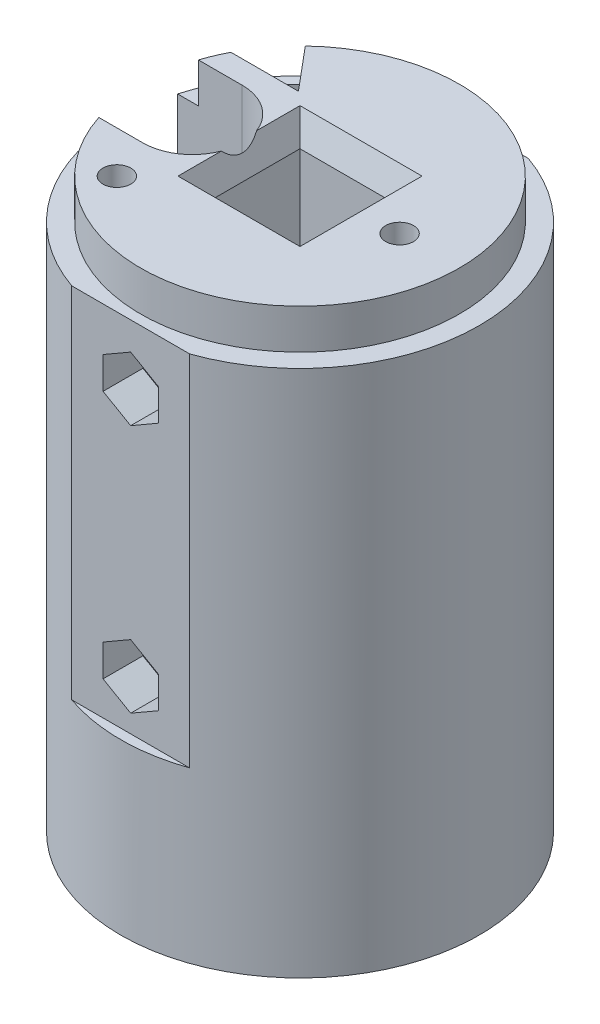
ISO-10303-21;
HEADER;
FILE_DESCRIPTION(('STEP AP214'),'2;1');
FILE_NAME('part.step','',(''),(''),'','','');
FILE_SCHEMA(('AUTOMOTIVE_DESIGN { 1 0 10303 214 1 1 1 1 }'));
ENDSEC;
DATA;
#1=APPLICATION_CONTEXT('core data for automotive mechanical design processes');
#2=APPLICATION_PROTOCOL_DEFINITION('international standard','automotive_design',2000,#1);
#3=PRODUCT_CONTEXT('',#1,'mechanical');
#4=PRODUCT('Part','Part','',(#3));
#5=PRODUCT_RELATED_PRODUCT_CATEGORY('part','',(#4));
#6=PRODUCT_DEFINITION_FORMATION('','',#4);
#7=PRODUCT_DEFINITION_CONTEXT('part definition',#1,'design');
#8=PRODUCT_DEFINITION('design','',#6,#7);
#9=PRODUCT_DEFINITION_SHAPE('','',#8);
#10=(LENGTH_UNIT() NAMED_UNIT(*) SI_UNIT(.MILLI.,.METRE.));
#11=(NAMED_UNIT(*) PLANE_ANGLE_UNIT() SI_UNIT($,.RADIAN.));
#12=(NAMED_UNIT(*) SI_UNIT($,.STERADIAN.) SOLID_ANGLE_UNIT());
#13=UNCERTAINTY_MEASURE_WITH_UNIT(LENGTH_MEASURE(1.E-05),#10,'distance_accuracy_value','');
#14=(GEOMETRIC_REPRESENTATION_CONTEXT(3) GLOBAL_UNCERTAINTY_ASSIGNED_CONTEXT((#13)) GLOBAL_UNIT_ASSIGNED_CONTEXT((#10,
#11,#12)) REPRESENTATION_CONTEXT('',''));
#15=CARTESIAN_POINT('',(0.,0.,0.));
#16=DIRECTION('',(0.,0.,1.));
#17=DIRECTION('',(1.,0.,0.));
#18=AXIS2_PLACEMENT_3D('',#15,#16,#17);
#19=CARTESIAN_POINT('',(0.,57.,0.));
#20=DIRECTION('',(0.,1.,0.));
#21=DIRECTION('',(0.,0.,1.));
#22=AXIS2_PLACEMENT_3D('',#19,#20,#21);
#23=PLANE('',#22);
#24=CARTESIAN_POINT('',(-9.19238815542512,57.,9.19238815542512));
#25=DIRECTION('',(0.,1.,0.));
#26=DIRECTION('',(0.,0.,1.));
#27=AXIS2_PLACEMENT_3D('',#24,#25,#26);
#28=CIRCLE('',#27,1.4);
#29=CARTESIAN_POINT('',(-9.19238815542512,57.,10.5923881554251));
#30=VERTEX_POINT('',#29);
#31=EDGE_CURVE('E320',#30,#30,#28,.T.);
#32=ORIENTED_EDGE('',*,*,#31,.F.);
#33=EDGE_LOOP('',(#32));
#34=FACE_BOUND('',#33,.T.);
#35=CARTESIAN_POINT('',(10.,57.,0.));
#36=DIRECTION('',(0.,1.,0.));
#37=DIRECTION('',(0.,0.,1.));
#38=AXIS2_PLACEMENT_3D('',#35,#36,#37);
#39=CIRCLE('',#38,1.4);
#40=CARTESIAN_POINT('',(10.,57.,1.4));
#41=VERTEX_POINT('',#40);
#42=EDGE_CURVE('E324',#41,#41,#39,.T.);
#43=ORIENTED_EDGE('',*,*,#42,.F.);
#44=EDGE_LOOP('',(#43));
#45=FACE_BOUND('',#44,.T.);
#46=DIRECTION('',(-1.,0.,0.));
#47=VECTOR('',#46,1.);
#48=CARTESIAN_POINT('',(-7.45420317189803,57.,-7.29788996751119));
#49=LINE('',#48,#47);
#50=CARTESIAN_POINT('',(-7.45420317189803,57.,-7.29788996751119));
#51=VERTEX_POINT('',#50);
#52=CARTESIAN_POINT('',(-14.2387078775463,57.,-7.2978899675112));
#53=VERTEX_POINT('',#52);
#54=EDGE_CURVE('E333',#51,#53,#49,.T.);
#55=ORIENTED_EDGE('',*,*,#54,.T.);
#56=CARTESIAN_POINT('',(0.,57.,0.));
#57=DIRECTION('',(0.,1.,0.));
#58=DIRECTION('',(0.,0.,1.));
#59=AXIS2_PLACEMENT_3D('',#56,#57,#58);
#60=CIRCLE('',#59,16.);
#61=CARTESIAN_POINT('',(-15.1986841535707,57.,-5.));
#62=VERTEX_POINT('',#61);
#63=EDGE_CURVE('E50',#53,#62,#60,.T.);
#64=ORIENTED_EDGE('',*,*,#63,.T.);
#65=DIRECTION('',(-1.,0.,0.));
#66=VECTOR('',#65,1.);
#67=CARTESIAN_POINT('',(-10.8,57.,-5.));
#68=LINE('',#67,#66);
#69=CARTESIAN_POINT('',(-10.8,57.,-5.));
#70=VERTEX_POINT('',#69);
#71=EDGE_CURVE('E543',#70,#62,#68,.T.);
#72=ORIENTED_EDGE('',*,*,#71,.F.);
#73=CARTESIAN_POINT('',(-10.8,57.,0.));
#74=DIRECTION('',(0.,1.,0.));
#75=DIRECTION('',(0.,0.,-1.));
#76=AXIS2_PLACEMENT_3D('',#73,#74,#75);
#77=CIRCLE('',#76,5.);
#78=CARTESIAN_POINT('',(-6.12500000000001,57.,-1.77323856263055));
#79=VERTEX_POINT('',#78);
#80=EDGE_CURVE('E544',#79,#70,#77,.T.);
#81=ORIENTED_EDGE('',*,*,#80,.F.);
#82=DIRECTION('',(0.,0.,-1.));
#83=VECTOR('',#82,1.);
#84=CARTESIAN_POINT('',(-6.12500000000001,57.,0.));
#85=LINE('',#84,#83);
#86=CARTESIAN_POINT('',(-6.12500000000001,57.,-6.12499999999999));
#87=VERTEX_POINT('',#86);
#88=EDGE_CURVE('E604',#79,#87,#85,.T.);
#89=ORIENTED_EDGE('',*,*,#88,.T.);
#90=DIRECTION('',(1.,0.,0.));
#91=VECTOR('',#90,1.);
#92=CARTESIAN_POINT('',(0.,57.,-6.125));
#93=LINE('',#92,#91);
#94=CARTESIAN_POINT('',(6.12499999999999,57.,-6.125));
#95=VERTEX_POINT('',#94);
#96=EDGE_CURVE('E602',#87,#95,#93,.T.);
#97=ORIENTED_EDGE('',*,*,#96,.T.);
#98=DIRECTION('',(0.,0.,1.));
#99=VECTOR('',#98,1.);
#100=CARTESIAN_POINT('',(6.12499999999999,57.,0.));
#101=LINE('',#100,#99);
#102=CARTESIAN_POINT('',(6.12499999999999,57.,6.125));
#103=VERTEX_POINT('',#102);
#104=EDGE_CURVE('E598',#95,#103,#101,.T.);
#105=ORIENTED_EDGE('',*,*,#104,.T.);
#106=DIRECTION('',(-1.,0.,0.));
#107=VECTOR('',#106,1.);
#108=CARTESIAN_POINT('',(0.,57.,6.125));
#109=LINE('',#108,#107);
#110=CARTESIAN_POINT('',(-6.125,57.,6.125));
#111=VERTEX_POINT('',#110);
#112=EDGE_CURVE('E600',#103,#111,#109,.T.);
#113=ORIENTED_EDGE('',*,*,#112,.T.);
#114=DIRECTION('',(0.,0.,-1.));
#115=VECTOR('',#114,1.);
#116=CARTESIAN_POINT('',(-6.12500000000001,57.,0.));
#117=LINE('',#116,#115);
#118=CARTESIAN_POINT('',(-6.125,57.,1.77323856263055));
#119=VERTEX_POINT('',#118);
#120=EDGE_CURVE('E606',#111,#119,#117,.T.);
#121=ORIENTED_EDGE('',*,*,#120,.T.);
#122=CARTESIAN_POINT('',(-10.8,57.,5.));
#123=VERTEX_POINT('',#122);
#124=EDGE_CURVE('E540',#123,#119,#77,.T.);
#125=ORIENTED_EDGE('',*,*,#124,.F.);
#126=DIRECTION('',(1.,0.,0.));
#127=VECTOR('',#126,1.);
#128=CARTESIAN_POINT('',(-10.8,57.,5.));
#129=LINE('',#128,#127);
#130=CARTESIAN_POINT('',(-15.1986841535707,57.,5.));
#131=VERTEX_POINT('',#130);
#132=EDGE_CURVE('E532',#131,#123,#129,.T.);
#133=ORIENTED_EDGE('',*,*,#132,.F.);
#134=CARTESIAN_POINT('',(-11.0445089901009,57.,-11.5766498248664));
#135=VERTEX_POINT('',#134);
#136=EDGE_CURVE('E699',#131,#135,#60,.T.);
#137=ORIENTED_EDGE('',*,*,#136,.T.);
#138=DIRECTION('',(0.642787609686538,0.,0.766044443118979));
#139=VECTOR('',#138,1.);
#140=CARTESIAN_POINT('',(-7.45420317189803,57.,-7.29788996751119));
#141=LINE('',#140,#139);
#142=EDGE_CURVE('E301',#135,#51,#141,.T.);
#143=ORIENTED_EDGE('',*,*,#142,.T.);
#144=EDGE_LOOP('',(#55,#64,#72,#81,#89,#97,#105,#113,#121,#125,#133,#137,#143));
#145=FACE_BOUND('',#144,.T.);
#146=ADVANCED_FACE('F35',(#34,#45,#145),#23,.T.);
#147=CARTESIAN_POINT('',(0.,57.,0.));
#148=DIRECTION('',(0.,-1.,0.));
#149=DIRECTION('',(0.,0.,-1.));
#150=AXIS2_PLACEMENT_3D('',#147,#148,#149);
#151=CYLINDRICAL_SURFACE('',#150,18.);
#152=CARTESIAN_POINT('',(0.,0.,0.));
#153=DIRECTION('',(0.,1.,0.));
#154=DIRECTION('',(0.,0.,1.));
#155=AXIS2_PLACEMENT_3D('',#152,#153,#154);
#156=CIRCLE('',#155,18.);
#157=CARTESIAN_POINT('',(0.,0.,18.));
#158=VERTEX_POINT('',#157);
#159=EDGE_CURVE('E580',#158,#158,#156,.T.);
#160=ORIENTED_EDGE('',*,*,#159,.T.);
#161=EDGE_LOOP('',(#160));
#162=FACE_BOUND('',#161,.T.);
#163=CARTESIAN_POINT('',(0.,53.,0.));
#164=DIRECTION('',(0.,1.,0.));
#165=DIRECTION('',(0.,0.,1.));
#166=AXIS2_PLACEMENT_3D('',#163,#164,#165);
#167=CIRCLE('',#166,18.);
#168=CARTESIAN_POINT('',(5.91607978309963,53.,17.));
#169=VERTEX_POINT('',#168);
#170=CARTESIAN_POINT('',(5.91607978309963,53.,-17.));
#171=VERTEX_POINT('',#170);
#172=EDGE_CURVE('E303',#169,#171,#167,.T.);
#173=ORIENTED_EDGE('',*,*,#172,.F.);
#174=DIRECTION('',(0.,1.,0.));
#175=VECTOR('',#174,1.);
#176=CARTESIAN_POINT('',(5.91607978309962,17.,17.));
#177=LINE('',#176,#175);
#178=CARTESIAN_POINT('',(5.91607978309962,17.,17.));
#179=VERTEX_POINT('',#178);
#180=EDGE_CURVE('E479',#179,#169,#177,.T.);
#181=ORIENTED_EDGE('',*,*,#180,.F.);
#182=CARTESIAN_POINT('',(0.,17.,0.));
#183=DIRECTION('',(0.,1.,0.));
#184=DIRECTION('',(0.,0.,-1.));
#185=AXIS2_PLACEMENT_3D('',#182,#183,#184);
#186=CIRCLE('',#185,18.0000000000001);
#187=CARTESIAN_POINT('',(-5.91607978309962,17.,17.));
#188=VERTEX_POINT('',#187);
#189=EDGE_CURVE('E475',#188,#179,#186,.T.);
#190=ORIENTED_EDGE('',*,*,#189,.F.);
#191=DIRECTION('',(0.,1.,0.));
#192=VECTOR('',#191,1.);
#193=CARTESIAN_POINT('',(-5.91607978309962,17.,17.));
#194=LINE('',#193,#192);
#195=CARTESIAN_POINT('',(-5.91607978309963,53.,17.));
#196=VERTEX_POINT('',#195);
#197=EDGE_CURVE('E480',#188,#196,#194,.T.);
#198=ORIENTED_EDGE('',*,*,#197,.T.);
#199=CARTESIAN_POINT('',(-17.2916164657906,53.,5.));
#200=VERTEX_POINT('',#199);
#201=EDGE_CURVE('E308',#200,#196,#167,.T.);
#202=ORIENTED_EDGE('',*,*,#201,.F.);
#203=DIRECTION('',(0.,1.,0.));
#204=VECTOR('',#203,1.);
#205=CARTESIAN_POINT('',(-17.2916164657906,30.,4.99999999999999));
#206=LINE('',#205,#204);
#207=CARTESIAN_POINT('',(-17.2916164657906,30.,4.99999999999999));
#208=VERTEX_POINT('',#207);
#209=EDGE_CURVE('E552',#208,#200,#206,.T.);
#210=ORIENTED_EDGE('',*,*,#209,.F.);
#211=CARTESIAN_POINT('',(0.,30.,0.));
#212=DIRECTION('',(0.,1.,0.));
#213=DIRECTION('',(0.,0.,1.));
#214=AXIS2_PLACEMENT_3D('',#211,#212,#213);
#215=CIRCLE('',#214,18.);
#216=CARTESIAN_POINT('',(-17.2916164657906,30.,-5.));
#217=VERTEX_POINT('',#216);
#218=EDGE_CURVE('E534',#217,#208,#215,.T.);
#219=ORIENTED_EDGE('',*,*,#218,.F.);
#220=DIRECTION('',(0.,1.,0.));
#221=VECTOR('',#220,1.);
#222=CARTESIAN_POINT('',(-17.2916164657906,30.,-5.));
#223=LINE('',#222,#221);
#224=CARTESIAN_POINT('',(-17.2916164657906,53.,-5.));
#225=VERTEX_POINT('',#224);
#226=EDGE_CURVE('E555',#217,#225,#223,.T.);
#227=ORIENTED_EDGE('',*,*,#226,.T.);
#228=CARTESIAN_POINT('',(-5.91607978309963,53.,-17.));
#229=VERTEX_POINT('',#228);
#230=EDGE_CURVE('E306',#229,#225,#167,.T.);
#231=ORIENTED_EDGE('',*,*,#230,.F.);
#232=DIRECTION('',(0.,1.,0.));
#233=VECTOR('',#232,1.);
#234=CARTESIAN_POINT('',(-5.91607978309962,17.,-17.));
#235=LINE('',#234,#233);
#236=CARTESIAN_POINT('',(-5.91607978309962,17.,-17.));
#237=VERTEX_POINT('',#236);
#238=EDGE_CURVE('E489',#237,#229,#235,.T.);
#239=ORIENTED_EDGE('',*,*,#238,.F.);
#240=CARTESIAN_POINT('',(0.,17.,0.));
#241=DIRECTION('',(0.,1.,0.));
#242=DIRECTION('',(0.,0.,1.));
#243=AXIS2_PLACEMENT_3D('',#240,#241,#242);
#244=CIRCLE('',#243,18.0000000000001);
#245=CARTESIAN_POINT('',(5.91607978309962,17.,-17.));
#246=VERTEX_POINT('',#245);
#247=EDGE_CURVE('E483',#246,#237,#244,.T.);
#248=ORIENTED_EDGE('',*,*,#247,.F.);
#249=DIRECTION('',(0.,1.,0.));
#250=VECTOR('',#249,1.);
#251=CARTESIAN_POINT('',(5.91607978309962,17.,-17.));
#252=LINE('',#251,#250);
#253=EDGE_CURVE('E490',#246,#171,#252,.T.);
#254=ORIENTED_EDGE('',*,*,#253,.T.);
#255=EDGE_LOOP('',(#173,#181,#190,#198,#202,#210,#219,#227,#231,#239,#248,#254));
#256=FACE_BOUND('',#255,.T.);
#257=ADVANCED_FACE('F709',(#162,#256),#151,.T.);
#258=CARTESIAN_POINT('',(-10.8,30.,5.));
#259=DIRECTION('',(0.,0.,1.));
#260=DIRECTION('',(1.,0.,0.));
#261=AXIS2_PLACEMENT_3D('',#258,#259,#260);
#262=PLANE('',#261);
#263=DIRECTION('',(-1.,0.,0.));
#264=VECTOR('',#263,1.);
#265=CARTESIAN_POINT('',(-10.8,53.,5.));
#266=LINE('',#265,#264);
#267=CARTESIAN_POINT('',(-15.1986841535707,53.,5.));
#268=VERTEX_POINT('',#267);
#269=EDGE_CURVE('E318',#268,#200,#266,.T.);
#270=ORIENTED_EDGE('',*,*,#269,.F.);
#271=DIRECTION('',(0.,1.,0.));
#272=VECTOR('',#271,1.);
#273=CARTESIAN_POINT('',(-15.1986841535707,53.,5.));
#274=LINE('',#273,#272);
#275=EDGE_CURVE('E296',#131,#268,#274,.F.);
#276=ORIENTED_EDGE('',*,*,#275,.F.);
#277=ORIENTED_EDGE('',*,*,#132,.T.);
#278=DIRECTION('',(0.,1.,0.));
#279=VECTOR('',#278,1.);
#280=CARTESIAN_POINT('',(-10.8,30.,5.));
#281=LINE('',#280,#279);
#282=CARTESIAN_POINT('',(-10.8,30.,5.));
#283=VERTEX_POINT('',#282);
#284=EDGE_CURVE('E548',#283,#123,#281,.T.);
#285=ORIENTED_EDGE('',*,*,#284,.F.);
#286=DIRECTION('',(1.,0.,0.));
#287=VECTOR('',#286,1.);
#288=CARTESIAN_POINT('',(-10.8,30.,5.));
#289=LINE('',#288,#287);
#290=EDGE_CURVE('E536',#208,#283,#289,.T.);
#291=ORIENTED_EDGE('',*,*,#290,.F.);
#292=ORIENTED_EDGE('',*,*,#209,.T.);
#293=EDGE_LOOP('',(#270,#276,#277,#285,#291,#292));
#294=FACE_BOUND('',#293,.T.);
#295=ADVANCED_FACE('F697',(#294),#262,.F.);
#296=CARTESIAN_POINT('',(-10.8,30.,-5.));
#297=DIRECTION('',(0.,0.,-1.));
#298=DIRECTION('',(-1.,0.,0.));
#299=AXIS2_PLACEMENT_3D('',#296,#297,#298);
#300=PLANE('',#299);
#301=DIRECTION('',(1.,0.,0.));
#302=VECTOR('',#301,1.);
#303=CARTESIAN_POINT('',(-10.8,53.,-5.));
#304=LINE('',#303,#302);
#305=CARTESIAN_POINT('',(-15.1986841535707,53.,-5.));
#306=VERTEX_POINT('',#305);
#307=EDGE_CURVE('E316',#225,#306,#304,.T.);
#308=ORIENTED_EDGE('',*,*,#307,.F.);
#309=ORIENTED_EDGE('',*,*,#226,.F.);
#310=DIRECTION('',(-1.,0.,0.));
#311=VECTOR('',#310,1.);
#312=CARTESIAN_POINT('',(-10.8,30.,-5.));
#313=LINE('',#312,#311);
#314=CARTESIAN_POINT('',(-10.8,30.,-5.));
#315=VERTEX_POINT('',#314);
#316=EDGE_CURVE('E531',#315,#217,#313,.T.);
#317=ORIENTED_EDGE('',*,*,#316,.F.);
#318=DIRECTION('',(0.,1.,0.));
#319=VECTOR('',#318,1.);
#320=CARTESIAN_POINT('',(-10.8,30.,-5.));
#321=LINE('',#320,#319);
#322=EDGE_CURVE('E539',#315,#70,#321,.T.);
#323=ORIENTED_EDGE('',*,*,#322,.T.);
#324=ORIENTED_EDGE('',*,*,#71,.T.);
#325=DIRECTION('',(0.,1.,0.));
#326=VECTOR('',#325,1.);
#327=CARTESIAN_POINT('',(-15.1986841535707,53.,-5.));
#328=LINE('',#327,#326);
#329=EDGE_CURVE('E302',#306,#62,#328,.T.);
#330=ORIENTED_EDGE('',*,*,#329,.F.);
#331=EDGE_LOOP('',(#308,#309,#317,#323,#324,#330));
#332=FACE_BOUND('',#331,.T.);
#333=ADVANCED_FACE('F701',(#332),#300,.F.);
#334=CARTESIAN_POINT('',(5.91607978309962,17.,-17.));
#335=DIRECTION('',(0.,0.,1.));
#336=DIRECTION('',(1.,0.,0.));
#337=AXIS2_PLACEMENT_3D('',#334,#335,#336);
#338=PLANE('',#337);
#339=CARTESIAN_POINT('',(0.,47.,-17.));
#340=DIRECTION('',(0.,0.,-1.));
#341=DIRECTION('',(-1.,0.,0.));
#342=AXIS2_PLACEMENT_3D('',#339,#340,#341);
#343=CIRCLE('',#342,3.);
#344=CARTESIAN_POINT('',(-3.00000000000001,47.,-17.));
#345=VERTEX_POINT('',#344);
#346=EDGE_CURVE('E460',#345,#345,#343,.T.);
#347=ORIENTED_EDGE('',*,*,#346,.F.);
#348=EDGE_LOOP('',(#347));
#349=FACE_BOUND('',#348,.T.);
#350=CARTESIAN_POINT('',(0.,22.,-17.));
#351=DIRECTION('',(0.,0.,-1.));
#352=DIRECTION('',(-1.,0.,0.));
#353=AXIS2_PLACEMENT_3D('',#350,#351,#352);
#354=CIRCLE('',#353,3.);
#355=CARTESIAN_POINT('',(-3.00000000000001,22.,-17.));
#356=VERTEX_POINT('',#355);
#357=EDGE_CURVE('E453',#356,#356,#354,.T.);
#358=ORIENTED_EDGE('',*,*,#357,.F.);
#359=EDGE_LOOP('',(#358));
#360=FACE_BOUND('',#359,.T.);
#361=DIRECTION('',(-1.,0.,0.));
#362=VECTOR('',#361,1.);
#363=CARTESIAN_POINT('',(5.91607978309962,53.,-17.));
#364=LINE('',#363,#362);
#365=EDGE_CURVE('E314',#171,#229,#364,.T.);
#366=ORIENTED_EDGE('',*,*,#365,.F.);
#367=ORIENTED_EDGE('',*,*,#253,.F.);
#368=DIRECTION('',(1.,0.,0.));
#369=VECTOR('',#368,1.);
#370=CARTESIAN_POINT('',(5.91607978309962,17.,-17.));
#371=LINE('',#370,#369);
#372=EDGE_CURVE('E487',#237,#246,#371,.T.);
#373=ORIENTED_EDGE('',*,*,#372,.F.);
#374=ORIENTED_EDGE('',*,*,#238,.T.);
#375=EDGE_LOOP('',(#366,#367,#373,#374));
#376=FACE_BOUND('',#375,.T.);
#377=ADVANCED_FACE('F895',(#349,#360,#376),#338,.F.);
#378=CARTESIAN_POINT('',(5.91607978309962,17.,17.));
#379=DIRECTION('',(0.,0.,-1.));
#380=DIRECTION('',(-1.,0.,0.));
#381=AXIS2_PLACEMENT_3D('',#378,#379,#380);
#382=PLANE('',#381);
#383=DIRECTION('',(0.866025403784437,0.500000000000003,0.));
#384=VECTOR('',#383,1.);
#385=CARTESIAN_POINT('',(0.,43.8,17.));
#386=LINE('',#385,#384);
#387=CARTESIAN_POINT('',(0.,43.8,17.));
#388=VERTEX_POINT('',#387);
#389=CARTESIAN_POINT('',(2.7712812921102,45.4,17.));
#390=VERTEX_POINT('',#389);
#391=EDGE_CURVE('E422',#388,#390,#386,.T.);
#392=ORIENTED_EDGE('',*,*,#391,.F.);
#393=DIRECTION('',(0.866025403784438,-0.500000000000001,0.));
#394=VECTOR('',#393,1.);
#395=CARTESIAN_POINT('',(-2.7712812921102,45.4,17.));
#396=LINE('',#395,#394);
#397=CARTESIAN_POINT('',(-2.7712812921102,45.4,17.));
#398=VERTEX_POINT('',#397);
#399=EDGE_CURVE('E420',#398,#388,#396,.T.);
#400=ORIENTED_EDGE('',*,*,#399,.F.);
#401=DIRECTION('',(0.,-1.,0.));
#402=VECTOR('',#401,1.);
#403=CARTESIAN_POINT('',(-2.7712812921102,48.6,17.));
#404=LINE('',#403,#402);
#405=CARTESIAN_POINT('',(-2.7712812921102,48.6,17.));
#406=VERTEX_POINT('',#405);
#407=EDGE_CURVE('E404',#406,#398,#404,.T.);
#408=ORIENTED_EDGE('',*,*,#407,.F.);
#409=DIRECTION('',(-0.866025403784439,-0.5,0.));
#410=VECTOR('',#409,1.);
#411=CARTESIAN_POINT('',(0.,50.2,17.));
#412=LINE('',#411,#410);
#413=CARTESIAN_POINT('',(0.,50.2,17.));
#414=VERTEX_POINT('',#413);
#415=EDGE_CURVE('E431',#414,#406,#412,.T.);
#416=ORIENTED_EDGE('',*,*,#415,.F.);
#417=DIRECTION('',(-0.866025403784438,0.5,0.));
#418=VECTOR('',#417,1.);
#419=CARTESIAN_POINT('',(2.7712812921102,48.6,17.));
#420=LINE('',#419,#418);
#421=CARTESIAN_POINT('',(2.7712812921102,48.6,17.));
#422=VERTEX_POINT('',#421);
#423=EDGE_CURVE('E428',#422,#414,#420,.T.);
#424=ORIENTED_EDGE('',*,*,#423,.F.);
#425=DIRECTION('',(0.,1.,0.));
#426=VECTOR('',#425,1.);
#427=CARTESIAN_POINT('',(2.7712812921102,45.4,17.));
#428=LINE('',#427,#426);
#429=EDGE_CURVE('E425',#390,#422,#428,.T.);
#430=ORIENTED_EDGE('',*,*,#429,.F.);
#431=EDGE_LOOP('',(#392,#400,#408,#416,#424,#430));
#432=FACE_BOUND('',#431,.T.);
#433=DIRECTION('',(0.866025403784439,0.5,0.));
#434=VECTOR('',#433,1.);
#435=CARTESIAN_POINT('',(0.,18.8,17.));
#436=LINE('',#435,#434);
#437=CARTESIAN_POINT('',(0.,18.8,17.));
#438=VERTEX_POINT('',#437);
#439=CARTESIAN_POINT('',(2.7712812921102,20.4,17.));
#440=VERTEX_POINT('',#439);
#441=EDGE_CURVE('E372',#438,#440,#436,.T.);
#442=ORIENTED_EDGE('',*,*,#441,.F.);
#443=DIRECTION('',(0.866025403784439,-0.5,0.));
#444=VECTOR('',#443,1.);
#445=CARTESIAN_POINT('',(-2.77128129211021,20.4,17.));
#446=LINE('',#445,#444);
#447=CARTESIAN_POINT('',(-2.77128129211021,20.4,17.));
#448=VERTEX_POINT('',#447);
#449=EDGE_CURVE('E370',#448,#438,#446,.T.);
#450=ORIENTED_EDGE('',*,*,#449,.F.);
#451=DIRECTION('',(0.,-1.,0.));
#452=VECTOR('',#451,1.);
#453=CARTESIAN_POINT('',(-2.77128129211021,23.6,17.));
#454=LINE('',#453,#452);
#455=CARTESIAN_POINT('',(-2.77128129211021,23.6,17.));
#456=VERTEX_POINT('',#455);
#457=EDGE_CURVE('E354',#456,#448,#454,.T.);
#458=ORIENTED_EDGE('',*,*,#457,.F.);
#459=DIRECTION('',(-0.866025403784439,-0.5,0.));
#460=VECTOR('',#459,1.);
#461=CARTESIAN_POINT('',(0.,25.2,17.));
#462=LINE('',#461,#460);
#463=CARTESIAN_POINT('',(0.,25.2,17.));
#464=VERTEX_POINT('',#463);
#465=EDGE_CURVE('E382',#464,#456,#462,.T.);
#466=ORIENTED_EDGE('',*,*,#465,.F.);
#467=DIRECTION('',(-0.866025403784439,0.5,0.));
#468=VECTOR('',#467,1.);
#469=CARTESIAN_POINT('',(2.7712812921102,23.6,17.));
#470=LINE('',#469,#468);
#471=CARTESIAN_POINT('',(2.7712812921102,23.6,17.));
#472=VERTEX_POINT('',#471);
#473=EDGE_CURVE('E379',#472,#464,#470,.T.);
#474=ORIENTED_EDGE('',*,*,#473,.F.);
#475=DIRECTION('',(0.,1.,0.));
#476=VECTOR('',#475,1.);
#477=CARTESIAN_POINT('',(2.7712812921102,20.4,17.));
#478=LINE('',#477,#476);
#479=EDGE_CURVE('E376',#440,#472,#478,.T.);
#480=ORIENTED_EDGE('',*,*,#479,.F.);
#481=EDGE_LOOP('',(#442,#450,#458,#466,#474,#480));
#482=FACE_BOUND('',#481,.T.);
#483=DIRECTION('',(1.,0.,0.));
#484=VECTOR('',#483,1.);
#485=CARTESIAN_POINT('',(5.91607978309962,53.,17.));
#486=LINE('',#485,#484);
#487=EDGE_CURVE('E289',#196,#169,#486,.T.);
#488=ORIENTED_EDGE('',*,*,#487,.F.);
#489=ORIENTED_EDGE('',*,*,#197,.F.);
#490=DIRECTION('',(-1.,0.,0.));
#491=VECTOR('',#490,1.);
#492=CARTESIAN_POINT('',(5.91607978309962,17.,17.));
#493=LINE('',#492,#491);
#494=EDGE_CURVE('E477',#179,#188,#493,.T.);
#495=ORIENTED_EDGE('',*,*,#494,.F.);
#496=ORIENTED_EDGE('',*,*,#180,.T.);
#497=EDGE_LOOP('',(#488,#489,#495,#496));
#498=FACE_BOUND('',#497,.T.);
#499=ADVANCED_FACE('F715',(#432,#482,#498),#382,.F.);
#500=CARTESIAN_POINT('',(-7.45420317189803,57.,-7.29788996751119));
#501=DIRECTION('',(0.766044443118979,0.,-0.642787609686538));
#502=DIRECTION('',(-0.642787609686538,0.,-0.76604444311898));
#503=AXIS2_PLACEMENT_3D('',#500,#501,#502);
#504=PLANE('',#503);
#505=DIRECTION('',(0.642787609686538,0.,0.76604444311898));
#506=VECTOR('',#505,1.);
#507=CARTESIAN_POINT('',(-7.45420317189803,53.,-7.29788996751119));
#508=LINE('',#507,#506);
#509=CARTESIAN_POINT('',(-11.6323226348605,53.,-12.2771788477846));
#510=VERTEX_POINT('',#509);
#511=CARTESIAN_POINT('',(-11.0445089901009,53.,-11.5766498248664));
#512=VERTEX_POINT('',#511);
#513=EDGE_CURVE('E280',#510,#512,#508,.T.);
#514=ORIENTED_EDGE('',*,*,#513,.F.);
#515=DIRECTION('',(0.,-1.,0.));
#516=VECTOR('',#515,1.);
#517=CARTESIAN_POINT('',(-11.6323226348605,57.,-12.2771788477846));
#518=LINE('',#517,#516);
#519=CARTESIAN_POINT('',(-11.6323226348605,0.,-12.2771788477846));
#520=VERTEX_POINT('',#519);
#521=EDGE_CURVE('E344',#510,#520,#518,.T.);
#522=ORIENTED_EDGE('',*,*,#521,.T.);
#523=DIRECTION('',(0.642787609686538,0.,0.766044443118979));
#524=VECTOR('',#523,1.);
#525=CARTESIAN_POINT('',(-7.45420317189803,0.,-7.29788996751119));
#526=LINE('',#525,#524);
#527=CARTESIAN_POINT('',(-7.45420317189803,0.,-7.29788996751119));
#528=VERTEX_POINT('',#527);
#529=EDGE_CURVE('E58',#520,#528,#526,.T.);
#530=ORIENTED_EDGE('',*,*,#529,.T.);
#531=DIRECTION('',(0.,-1.,0.));
#532=VECTOR('',#531,1.);
#533=CARTESIAN_POINT('',(-7.45420317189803,57.,-7.29788996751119));
#534=LINE('',#533,#532);
#535=EDGE_CURVE('E337',#51,#528,#534,.T.);
#536=ORIENTED_EDGE('',*,*,#535,.F.);
#537=ORIENTED_EDGE('',*,*,#142,.F.);
#538=DIRECTION('',(0.,1.,0.));
#539=VECTOR('',#538,1.);
#540=CARTESIAN_POINT('',(-11.0445089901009,53.,-11.5766498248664));
#541=LINE('',#540,#539);
#542=EDGE_CURVE('E293',#512,#135,#541,.T.);
#543=ORIENTED_EDGE('',*,*,#542,.F.);
#544=EDGE_LOOP('',(#514,#522,#530,#536,#537,#543));
#545=FACE_BOUND('',#544,.T.);
#546=ADVANCED_FACE('F300',(#545),#504,.F.);
#547=CARTESIAN_POINT('',(0.516799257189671,57.,1.00434355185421));
#548=DIRECTION('',(0.,-1.,0.));
#549=DIRECTION('',(0.,0.,-1.));
#550=AXIS2_PLACEMENT_3D('',#547,#548,#549);
#551=CYLINDRICAL_SURFACE('',#550,18.);
#552=CARTESIAN_POINT('',(0.516799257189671,53.,1.00434355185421));
#553=DIRECTION('',(0.,1.,0.));
#554=DIRECTION('',(0.,0.,1.));
#555=AXIS2_PLACEMENT_3D('',#552,#553,#554);
#556=CIRCLE('',#555,18.);
#557=CARTESIAN_POINT('',(-15.454203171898,53.,-7.2978899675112));
#558=VERTEX_POINT('',#557);
#559=EDGE_CURVE('E286',#558,#510,#556,.F.);
#560=ORIENTED_EDGE('',*,*,#559,.F.);
#561=DIRECTION('',(0.,-1.,0.));
#562=VECTOR('',#561,1.);
#563=CARTESIAN_POINT('',(-15.454203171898,57.,-7.2978899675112));
#564=LINE('',#563,#562);
#565=CARTESIAN_POINT('',(-15.454203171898,0.,-7.2978899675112));
#566=VERTEX_POINT('',#565);
#567=EDGE_CURVE('E347',#558,#566,#564,.T.);
#568=ORIENTED_EDGE('',*,*,#567,.T.);
#569=CARTESIAN_POINT('',(0.516799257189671,0.,1.00434355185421));
#570=DIRECTION('',(0.,-1.,0.));
#571=DIRECTION('',(0.,0.,-1.));
#572=AXIS2_PLACEMENT_3D('',#569,#570,#571);
#573=CIRCLE('',#572,18.);
#574=EDGE_CURVE('E334',#566,#520,#573,.T.);
#575=ORIENTED_EDGE('',*,*,#574,.T.);
#576=ORIENTED_EDGE('',*,*,#521,.F.);
#577=EDGE_LOOP('',(#560,#568,#575,#576));
#578=FACE_BOUND('',#577,.T.);
#579=ADVANCED_FACE('F638',(#578),#551,.F.);
#580=CARTESIAN_POINT('',(-7.45420317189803,57.,-7.29788996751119));
#581=DIRECTION('',(0.,0.,1.));
#582=DIRECTION('',(1.,0.,0.));
#583=AXIS2_PLACEMENT_3D('',#580,#581,#582);
#584=PLANE('',#583);
#585=DIRECTION('',(-1.,0.,0.));
#586=VECTOR('',#585,1.);
#587=CARTESIAN_POINT('',(-7.45420317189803,53.,-7.29788996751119));
#588=LINE('',#587,#586);
#589=CARTESIAN_POINT('',(-14.2387078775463,53.,-7.2978899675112));
#590=VERTEX_POINT('',#589);
#591=EDGE_CURVE('E11',#590,#558,#588,.T.);
#592=ORIENTED_EDGE('',*,*,#591,.F.);
#593=DIRECTION('',(0.,1.,0.));
#594=VECTOR('',#593,1.);
#595=CARTESIAN_POINT('',(-14.2387078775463,53.,-7.29788996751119));
#596=LINE('',#595,#594);
#597=EDGE_CURVE('E43',#53,#590,#596,.F.);
#598=ORIENTED_EDGE('',*,*,#597,.F.);
#599=ORIENTED_EDGE('',*,*,#54,.F.);
#600=ORIENTED_EDGE('',*,*,#535,.T.);
#601=DIRECTION('',(-1.,0.,0.));
#602=VECTOR('',#601,1.);
#603=CARTESIAN_POINT('',(-7.45420317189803,0.,-7.29788996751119));
#604=LINE('',#603,#602);
#605=EDGE_CURVE('E339',#528,#566,#604,.T.);
#606=ORIENTED_EDGE('',*,*,#605,.T.);
#607=ORIENTED_EDGE('',*,*,#567,.F.);
#608=EDGE_LOOP('',(#592,#598,#599,#600,#606,#607));
#609=FACE_BOUND('',#608,.T.);
#610=ADVANCED_FACE('F634',(#609),#584,.F.);
#611=CARTESIAN_POINT('',(0.,22.,18.));
#612=DIRECTION('',(0.,0.,-1.));
#613=DIRECTION('',(-1.,0.,0.));
#614=AXIS2_PLACEMENT_3D('',#611,#612,#613);
#615=CYLINDRICAL_SURFACE('',#614,1.5);
#616=CARTESIAN_POINT('',(0.,22.,5.125));
#617=DIRECTION('',(0.,0.,-1.));
#618=DIRECTION('',(-1.,0.,0.));
#619=AXIS2_PLACEMENT_3D('',#616,#617,#618);
#620=CIRCLE('',#619,1.5);
#621=CARTESIAN_POINT('',(-1.50000000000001,22.,5.125));
#622=VERTEX_POINT('',#621);
#623=EDGE_CURVE('E466',#622,#622,#620,.T.);
#624=ORIENTED_EDGE('',*,*,#623,.T.);
#625=EDGE_LOOP('',(#624));
#626=FACE_BOUND('',#625,.T.);
#627=CARTESIAN_POINT('',(0.,22.,13.));
#628=DIRECTION('',(0.,0.,1.));
#629=DIRECTION('',(1.,0.,0.));
#630=AXIS2_PLACEMENT_3D('',#627,#628,#629);
#631=CIRCLE('',#630,1.5);
#632=CARTESIAN_POINT('',(1.5,22.,13.));
#633=VERTEX_POINT('',#632);
#634=EDGE_CURVE('E389',#633,#633,#631,.F.);
#635=ORIENTED_EDGE('',*,*,#634,.F.);
#636=EDGE_LOOP('',(#635));
#637=FACE_BOUND('',#636,.T.);
#638=ADVANCED_FACE('F818',(#626,#637),#615,.F.);
#639=CARTESIAN_POINT('',(0.,47.,18.));
#640=DIRECTION('',(0.,0.,-1.));
#641=DIRECTION('',(-1.,0.,0.));
#642=AXIS2_PLACEMENT_3D('',#639,#640,#641);
#643=CYLINDRICAL_SURFACE('',#642,1.5);
#644=CARTESIAN_POINT('',(0.,47.,5.125));
#645=DIRECTION('',(0.,0.,-1.));
#646=DIRECTION('',(-1.,0.,0.));
#647=AXIS2_PLACEMENT_3D('',#644,#645,#646);
#648=CIRCLE('',#647,1.5);
#649=CARTESIAN_POINT('',(-1.5,47.,5.125));
#650=VERTEX_POINT('',#649);
#651=EDGE_CURVE('E472',#650,#650,#648,.T.);
#652=ORIENTED_EDGE('',*,*,#651,.T.);
#653=EDGE_LOOP('',(#652));
#654=FACE_BOUND('',#653,.T.);
#655=CARTESIAN_POINT('',(0.,47.,13.));
#656=DIRECTION('',(0.,0.,1.));
#657=DIRECTION('',(1.,0.,0.));
#658=AXIS2_PLACEMENT_3D('',#655,#656,#657);
#659=CIRCLE('',#658,1.5);
#660=CARTESIAN_POINT('',(1.5,47.,13.));
#661=VERTEX_POINT('',#660);
#662=EDGE_CURVE('E438',#661,#661,#659,.F.);
#663=ORIENTED_EDGE('',*,*,#662,.F.);
#664=EDGE_LOOP('',(#663));
#665=FACE_BOUND('',#664,.T.);
#666=ADVANCED_FACE('F820',(#654,#665),#643,.F.);
#667=CARTESIAN_POINT('',(0.,22.,-5.125));
#668=DIRECTION('',(0.,0.,1.));
#669=DIRECTION('',(1.,0.,0.));
#670=AXIS2_PLACEMENT_3D('',#667,#668,#669);
#671=CIRCLE('',#670,1.5);
#672=CARTESIAN_POINT('',(1.5,22.,-5.125));
#673=VERTEX_POINT('',#672);
#674=EDGE_CURVE('E463',#673,#673,#671,.T.);
#675=ORIENTED_EDGE('',*,*,#674,.T.);
#676=EDGE_LOOP('',(#675));
#677=FACE_BOUND('',#676,.T.);
#678=CARTESIAN_POINT('',(0.,22.,-14.));
#679=DIRECTION('',(0.,0.,-1.));
#680=DIRECTION('',(-1.,0.,0.));
#681=AXIS2_PLACEMENT_3D('',#678,#679,#680);
#682=CIRCLE('',#681,1.5);
#683=CARTESIAN_POINT('',(-1.50000000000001,22.,-14.));
#684=VERTEX_POINT('',#683);
#685=EDGE_CURVE('E452',#684,#684,#682,.F.);
#686=ORIENTED_EDGE('',*,*,#685,.F.);
#687=EDGE_LOOP('',(#686));
#688=FACE_BOUND('',#687,.T.);
#689=ADVANCED_FACE('F822',(#677,#688),#615,.F.);
#690=CARTESIAN_POINT('',(0.,47.,-5.125));
#691=DIRECTION('',(0.,0.,1.));
#692=DIRECTION('',(1.,0.,0.));
#693=AXIS2_PLACEMENT_3D('',#690,#691,#692);
#694=CIRCLE('',#693,1.5);
#695=CARTESIAN_POINT('',(1.5,47.,-5.125));
#696=VERTEX_POINT('',#695);
#697=EDGE_CURVE('E469',#696,#696,#694,.T.);
#698=ORIENTED_EDGE('',*,*,#697,.T.);
#699=EDGE_LOOP('',(#698));
#700=FACE_BOUND('',#699,.T.);
#701=CARTESIAN_POINT('',(0.,47.,-14.));
#702=DIRECTION('',(0.,0.,-1.));
#703=DIRECTION('',(-1.,0.,0.));
#704=AXIS2_PLACEMENT_3D('',#701,#702,#703);
#705=CIRCLE('',#704,1.5);
#706=CARTESIAN_POINT('',(-1.5,47.,-14.));
#707=VERTEX_POINT('',#706);
#708=EDGE_CURVE('E459',#707,#707,#705,.F.);
#709=ORIENTED_EDGE('',*,*,#708,.F.);
#710=EDGE_LOOP('',(#709));
#711=FACE_BOUND('',#710,.T.);
#712=ADVANCED_FACE('F644',(#700,#711),#643,.F.);
#713=CARTESIAN_POINT('',(0.,0.,0.));
#714=DIRECTION('',(0.,1.,0.));
#715=DIRECTION('',(0.,0.,1.));
#716=AXIS2_PLACEMENT_3D('',#713,#714,#715);
#717=PLANE('',#716);
#718=ORIENTED_EDGE('',*,*,#605,.F.);
#719=ORIENTED_EDGE('',*,*,#529,.F.);
#720=ORIENTED_EDGE('',*,*,#574,.F.);
#721=EDGE_LOOP('',(#718,#719,#720));
#722=FACE_BOUND('',#721,.T.);
#723=DIRECTION('',(-1.,0.,0.));
#724=VECTOR('',#723,1.);
#725=CARTESIAN_POINT('',(-15.8103935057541,0.,3.80211003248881));
#726=LINE('',#725,#724);
#727=CARTESIAN_POINT('',(-6.46039350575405,0.,3.80211003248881));
#728=VERTEX_POINT('',#727);
#729=CARTESIAN_POINT('',(-15.8103935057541,0.,3.80211003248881));
#730=VERTEX_POINT('',#729);
#731=EDGE_CURVE('E511',#728,#730,#726,.T.);
#732=ORIENTED_EDGE('',*,*,#731,.F.);
#733=DIRECTION('',(0.,0.,1.));
#734=VECTOR('',#733,1.);
#735=CARTESIAN_POINT('',(-6.46039350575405,0.,-5.54788996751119));
#736=LINE('',#735,#734);
#737=CARTESIAN_POINT('',(-6.46039350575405,0.,-5.54788996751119));
#738=VERTEX_POINT('',#737);
#739=EDGE_CURVE('E493',#738,#728,#736,.T.);
#740=ORIENTED_EDGE('',*,*,#739,.F.);
#741=DIRECTION('',(1.,0.,0.));
#742=VECTOR('',#741,1.);
#743=CARTESIAN_POINT('',(-15.8103935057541,0.,-5.54788996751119));
#744=LINE('',#743,#742);
#745=CARTESIAN_POINT('',(-15.8103935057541,0.,-5.54788996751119));
#746=VERTEX_POINT('',#745);
#747=EDGE_CURVE('E500',#746,#738,#744,.T.);
#748=ORIENTED_EDGE('',*,*,#747,.F.);
#749=DIRECTION('',(0.,0.,-1.));
#750=VECTOR('',#749,1.);
#751=CARTESIAN_POINT('',(-15.8103935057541,0.,-5.54788996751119));
#752=LINE('',#751,#750);
#753=EDGE_CURVE('E514',#730,#746,#752,.T.);
#754=ORIENTED_EDGE('',*,*,#753,.F.);
#755=EDGE_LOOP('',(#732,#740,#748,#754));
#756=FACE_BOUND('',#755,.T.);
#757=ORIENTED_EDGE('',*,*,#159,.F.);
#758=EDGE_LOOP('',(#757));
#759=FACE_BOUND('',#758,.T.);
#760=DIRECTION('',(0.,0.,1.));
#761=VECTOR('',#760,1.);
#762=CARTESIAN_POINT('',(-5.125,0.,5.125));
#763=LINE('',#762,#761);
#764=CARTESIAN_POINT('',(-5.12500000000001,0.,-5.125));
#765=VERTEX_POINT('',#764);
#766=CARTESIAN_POINT('',(-5.125,0.,5.125));
#767=VERTEX_POINT('',#766);
#768=EDGE_CURVE('E560',#765,#767,#763,.T.);
#769=ORIENTED_EDGE('',*,*,#768,.T.);
#770=DIRECTION('',(1.,0.,0.));
#771=VECTOR('',#770,1.);
#772=CARTESIAN_POINT('',(5.12499999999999,0.,5.125));
#773=LINE('',#772,#771);
#774=CARTESIAN_POINT('',(5.12499999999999,0.,5.125));
#775=VERTEX_POINT('',#774);
#776=EDGE_CURVE('E563',#767,#775,#773,.T.);
#777=ORIENTED_EDGE('',*,*,#776,.T.);
#778=DIRECTION('',(0.,0.,-1.));
#779=VECTOR('',#778,1.);
#780=CARTESIAN_POINT('',(5.12499999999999,0.,5.125));
#781=LINE('',#780,#779);
#782=CARTESIAN_POINT('',(5.12499999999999,0.,-5.12500000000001));
#783=VERTEX_POINT('',#782);
#784=EDGE_CURVE('E566',#775,#783,#781,.T.);
#785=ORIENTED_EDGE('',*,*,#784,.T.);
#786=DIRECTION('',(-1.,0.,0.));
#787=VECTOR('',#786,1.);
#788=CARTESIAN_POINT('',(5.12499999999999,0.,-5.12500000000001));
#789=LINE('',#788,#787);
#790=EDGE_CURVE('E569',#783,#765,#789,.T.);
#791=ORIENTED_EDGE('',*,*,#790,.T.);
#792=EDGE_LOOP('',(#769,#777,#785,#791));
#793=FACE_BOUND('',#792,.T.);
#794=ADVANCED_FACE('F640',(#722,#756,#759,#793),#717,.F.);
#795=CARTESIAN_POINT('',(-5.125,57.,5.125));
#796=DIRECTION('',(1.,0.,0.));
#797=DIRECTION('',(0.,0.,-1.));
#798=AXIS2_PLACEMENT_3D('',#795,#796,#797);
#799=PLANE('',#798);
#800=DIRECTION('',(0.,-1.,0.));
#801=VECTOR('',#800,1.);
#802=CARTESIAN_POINT('',(-5.12500000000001,57.,-5.125));
#803=LINE('',#802,#801);
#804=CARTESIAN_POINT('',(-5.12500000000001,54.2525225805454,-5.125));
#805=VERTEX_POINT('',#804);
#806=EDGE_CURVE('E572',#805,#765,#803,.T.);
#807=ORIENTED_EDGE('',*,*,#806,.F.);
#808=DIRECTION('',(0.,0.,1.));
#809=VECTOR('',#808,1.);
#810=CARTESIAN_POINT('',(-5.125,54.2525225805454,5.125));
#811=LINE('',#810,#809);
#812=CARTESIAN_POINT('',(-5.125,54.2525225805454,5.125));
#813=VERTEX_POINT('',#812);
#814=EDGE_CURVE('E583',#805,#813,#811,.T.);
#815=ORIENTED_EDGE('',*,*,#814,.T.);
#816=DIRECTION('',(0.,-1.,0.));
#817=VECTOR('',#816,1.);
#818=CARTESIAN_POINT('',(-5.125,57.,5.125));
#819=LINE('',#818,#817);
#820=EDGE_CURVE('E578',#813,#767,#819,.T.);
#821=ORIENTED_EDGE('',*,*,#820,.T.);
#822=ORIENTED_EDGE('',*,*,#768,.F.);
#823=EDGE_LOOP('',(#807,#815,#821,#822));
#824=FACE_BOUND('',#823,.T.);
#825=ADVANCED_FACE('F643',(#824),#799,.T.);
#826=CARTESIAN_POINT('',(5.12499999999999,57.,5.125));
#827=DIRECTION('',(0.,0.,-1.));
#828=DIRECTION('',(-1.,0.,0.));
#829=AXIS2_PLACEMENT_3D('',#826,#827,#828);
#830=PLANE('',#829);
#831=ORIENTED_EDGE('',*,*,#623,.F.);
#832=EDGE_LOOP('',(#831));
#833=FACE_BOUND('',#832,.T.);
#834=ORIENTED_EDGE('',*,*,#651,.F.);
#835=EDGE_LOOP('',(#834));
#836=FACE_BOUND('',#835,.T.);
#837=ORIENTED_EDGE('',*,*,#820,.F.);
#838=DIRECTION('',(1.,0.,0.));
#839=VECTOR('',#838,1.);
#840=CARTESIAN_POINT('',(5.12499999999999,54.2525225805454,5.125));
#841=LINE('',#840,#839);
#842=CARTESIAN_POINT('',(5.12499999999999,54.2525225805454,5.125));
#843=VERTEX_POINT('',#842);
#844=EDGE_CURVE('E613',#813,#843,#841,.T.);
#845=ORIENTED_EDGE('',*,*,#844,.T.);
#846=DIRECTION('',(0.,-1.,0.));
#847=VECTOR('',#846,1.);
#848=CARTESIAN_POINT('',(5.12499999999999,57.,5.125));
#849=LINE('',#848,#847);
#850=EDGE_CURVE('E576',#843,#775,#849,.T.);
#851=ORIENTED_EDGE('',*,*,#850,.T.);
#852=ORIENTED_EDGE('',*,*,#776,.F.);
#853=EDGE_LOOP('',(#837,#845,#851,#852));
#854=FACE_BOUND('',#853,.T.);
#855=ADVANCED_FACE('F661',(#833,#836,#854),#830,.T.);
#856=CARTESIAN_POINT('',(5.12499999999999,57.,5.125));
#857=DIRECTION('',(-1.,0.,0.));
#858=DIRECTION('',(0.,0.,1.));
#859=AXIS2_PLACEMENT_3D('',#856,#857,#858);
#860=PLANE('',#859);
#861=ORIENTED_EDGE('',*,*,#850,.F.);
#862=DIRECTION('',(0.,0.,-1.));
#863=VECTOR('',#862,1.);
#864=CARTESIAN_POINT('',(5.12499999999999,54.2525225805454,5.125));
#865=LINE('',#864,#863);
#866=CARTESIAN_POINT('',(5.12499999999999,54.2525225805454,-5.12500000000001));
#867=VERTEX_POINT('',#866);
#868=EDGE_CURVE('E615',#843,#867,#865,.T.);
#869=ORIENTED_EDGE('',*,*,#868,.T.);
#870=DIRECTION('',(0.,-1.,0.));
#871=VECTOR('',#870,1.);
#872=CARTESIAN_POINT('',(5.12499999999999,57.,-5.12500000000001));
#873=LINE('',#872,#871);
#874=EDGE_CURVE('E574',#867,#783,#873,.T.);
#875=ORIENTED_EDGE('',*,*,#874,.T.);
#876=ORIENTED_EDGE('',*,*,#784,.F.);
#877=EDGE_LOOP('',(#861,#869,#875,#876));
#878=FACE_BOUND('',#877,.T.);
#879=ADVANCED_FACE('F667',(#878),#860,.T.);
#880=CARTESIAN_POINT('',(5.12499999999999,57.,-5.12500000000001));
#881=DIRECTION('',(0.,0.,1.));
#882=DIRECTION('',(1.,0.,0.));
#883=AXIS2_PLACEMENT_3D('',#880,#881,#882);
#884=PLANE('',#883);
#885=ORIENTED_EDGE('',*,*,#674,.F.);
#886=EDGE_LOOP('',(#885));
#887=FACE_BOUND('',#886,.T.);
#888=ORIENTED_EDGE('',*,*,#697,.F.);
#889=EDGE_LOOP('',(#888));
#890=FACE_BOUND('',#889,.T.);
#891=ORIENTED_EDGE('',*,*,#874,.F.);
#892=DIRECTION('',(-1.,0.,0.));
#893=VECTOR('',#892,1.);
#894=CARTESIAN_POINT('',(5.12499999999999,54.2525225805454,-5.12500000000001));
#895=LINE('',#894,#893);
#896=EDGE_CURVE('E611',#867,#805,#895,.T.);
#897=ORIENTED_EDGE('',*,*,#896,.T.);
#898=ORIENTED_EDGE('',*,*,#806,.T.);
#899=ORIENTED_EDGE('',*,*,#790,.F.);
#900=EDGE_LOOP('',(#891,#897,#898,#899));
#901=FACE_BOUND('',#900,.T.);
#902=ADVANCED_FACE('F671',(#887,#890,#901),#884,.T.);
#903=CARTESIAN_POINT('',(-12.,57.,0.));
#904=DIRECTION('',(0.,-1.,0.));
#905=DIRECTION('',(0.,0.,-1.));
#906=AXIS2_PLACEMENT_3D('',#903,#904,#905);
#907=CYLINDRICAL_SURFACE('',#906,2.);
#908=CARTESIAN_POINT('',(-12.,20.4,0.));
#909=DIRECTION('',(0.,1.,0.));
#910=DIRECTION('',(0.,0.,1.));
#911=AXIS2_PLACEMENT_3D('',#908,#909,#910);
#912=CIRCLE('',#911,2.);
#913=CARTESIAN_POINT('',(-12.,20.4,-2.));
#914=VERTEX_POINT('',#913);
#915=EDGE_CURVE('E521',#914,#914,#912,.T.);
#916=CARTESIAN_POINT('',(-12.,30.,0.));
#917=DIRECTION('',(0.,-1.,0.));
#918=DIRECTION('',(0.,0.,-1.));
#919=AXIS2_PLACEMENT_3D('',#916,#917,#918);
#920=CIRCLE('',#919,2.);
#921=CARTESIAN_POINT('',(-12.,30.,-2.));
#922=VERTEX_POINT('',#921);
#923=EDGE_CURVE('E551',#922,#922,#920,.T.);
#924=CARTESIAN_POINT('',(-12.,20.4,-2.));
#925=CARTESIAN_POINT('',(-12.,20.5,-2.));
#926=CARTESIAN_POINT('',(-12.,20.6,-2.));
#927=CARTESIAN_POINT('',(-12.,20.8,-2.));
#928=CARTESIAN_POINT('',(-12.,20.9,-2.));
#929=CARTESIAN_POINT('',(-12.,21.1,-2.));
#930=CARTESIAN_POINT('',(-12.,21.2,-2.));
#931=CARTESIAN_POINT('',(-12.,21.4,-2.));
#932=CARTESIAN_POINT('',(-12.,21.5,-2.));
#933=CARTESIAN_POINT('',(-12.,21.7,-2.));
#934=CARTESIAN_POINT('',(-12.,21.8,-2.));
#935=CARTESIAN_POINT('',(-12.,22.,-2.));
#936=CARTESIAN_POINT('',(-12.,22.1,-2.));
#937=CARTESIAN_POINT('',(-12.,22.3,-2.));
#938=CARTESIAN_POINT('',(-12.,22.4,-2.));
#939=CARTESIAN_POINT('',(-12.,22.6,-2.));
#940=CARTESIAN_POINT('',(-12.,22.7,-2.));
#941=CARTESIAN_POINT('',(-12.,22.9,-2.));
#942=CARTESIAN_POINT('',(-12.,23.,-2.));
#943=CARTESIAN_POINT('',(-12.,23.2,-2.));
#944=CARTESIAN_POINT('',(-12.,23.3,-2.));
#945=CARTESIAN_POINT('',(-12.,23.5,-2.));
#946=CARTESIAN_POINT('',(-12.,23.6,-2.));
#947=CARTESIAN_POINT('',(-12.,23.8,-2.));
#948=CARTESIAN_POINT('',(-12.,23.9,-2.));
#949=CARTESIAN_POINT('',(-12.,24.1,-2.));
#950=CARTESIAN_POINT('',(-12.,24.2,-2.));
#951=CARTESIAN_POINT('',(-12.,24.4,-2.));
#952=CARTESIAN_POINT('',(-12.,24.5,-2.));
#953=CARTESIAN_POINT('',(-12.,24.7,-2.));
#954=CARTESIAN_POINT('',(-12.,24.8,-2.));
#955=CARTESIAN_POINT('',(-12.,25.,-2.));
#956=CARTESIAN_POINT('',(-12.,25.1,-2.));
#957=CARTESIAN_POINT('',(-12.,25.3,-2.));
#958=CARTESIAN_POINT('',(-12.,25.4,-2.));
#959=CARTESIAN_POINT('',(-12.,25.6,-2.));
#960=CARTESIAN_POINT('',(-12.,25.7,-2.));
#961=CARTESIAN_POINT('',(-12.,25.9,-2.));
#962=CARTESIAN_POINT('',(-12.,26.,-2.));
#963=CARTESIAN_POINT('',(-12.,26.2,-2.));
#964=CARTESIAN_POINT('',(-12.,26.3,-2.));
#965=CARTESIAN_POINT('',(-12.,26.5,-2.));
#966=CARTESIAN_POINT('',(-12.,26.6,-2.));
#967=CARTESIAN_POINT('',(-12.,26.8,-2.));
#968=CARTESIAN_POINT('',(-12.,26.9,-2.));
#969=CARTESIAN_POINT('',(-12.,27.1,-2.));
#970=CARTESIAN_POINT('',(-12.,27.2,-2.));
#971=CARTESIAN_POINT('',(-12.,27.4,-2.));
#972=CARTESIAN_POINT('',(-12.,27.5,-2.));
#973=CARTESIAN_POINT('',(-12.,27.7,-2.));
#974=CARTESIAN_POINT('',(-12.,27.8,-2.));
#975=CARTESIAN_POINT('',(-12.,28.,-2.));
#976=CARTESIAN_POINT('',(-12.,28.1,-2.));
#977=CARTESIAN_POINT('',(-12.,28.3,-2.));
#978=CARTESIAN_POINT('',(-12.,28.4,-2.));
#979=CARTESIAN_POINT('',(-12.,28.6,-2.));
#980=CARTESIAN_POINT('',(-12.,28.7,-2.));
#981=CARTESIAN_POINT('',(-12.,28.9,-2.));
#982=CARTESIAN_POINT('',(-12.,29.,-2.));
#983=CARTESIAN_POINT('',(-12.,29.2,-2.));
#984=CARTESIAN_POINT('',(-12.,29.3,-2.));
#985=CARTESIAN_POINT('',(-12.,29.5,-2.));
#986=CARTESIAN_POINT('',(-12.,29.6,-2.));
#987=CARTESIAN_POINT('',(-12.,29.8,-2.));
#988=CARTESIAN_POINT('',(-12.,29.9,-2.));
#989=CARTESIAN_POINT('',(-12.,30.,-2.));
#990=B_SPLINE_CURVE_WITH_KNOTS('',3,(#924,#925,#926,#927,#928,#929,#930,#931,#932,#933,#934,
#935,#936,#937,#938,#939,#940,#941,#942,#943,#944,#945,#946,#947,#948,#949,#950,#951,#952,#953,
#954,#955,#956,#957,#958,#959,#960,#961,#962,#963,#964,#965,#966,#967,#968,#969,#970,#971,#972,
#973,#974,#975,#976,#977,#978,#979,#980,#981,#982,#983,#984,#985,#986,#987,#988,#989),
.UNSPECIFIED.,.F.,.F.,(4,2,2,2,2,2,2,2,2,2,2,2,2,2,2,2,2,2,2,2,2,2,2,2,2,2,2,2,2,2,2,2,4),(0.,
0.300000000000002,0.600000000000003,0.900000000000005,1.2,1.5,1.8,2.1,2.40000000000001,
2.70000000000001,3.,3.3,3.60000000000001,3.90000000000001,4.20000000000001,4.50000000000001,
4.80000000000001,5.10000000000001,5.40000000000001,5.70000000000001,6.00000000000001,
6.30000000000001,6.60000000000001,6.90000000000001,7.20000000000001,7.50000000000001,
7.80000000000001,8.10000000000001,8.40000000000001,8.70000000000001,9.00000000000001,
9.30000000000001,9.60000000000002),.UNSPECIFIED.);
#991=EDGE_CURVE('BSEAM840',#914,#922,#990,.T.);
#992=ORIENTED_EDGE('',*,*,#915,.F.);
#993=ORIENTED_EDGE('',*,*,#923,.F.);
#994=ORIENTED_EDGE('',*,*,#991,.T.);
#995=ORIENTED_EDGE('',*,*,#991,.F.);
#996=EDGE_LOOP('',(#992,#994,#993,#995));
#997=FACE_BOUND('',#996,.T.);
#998=ADVANCED_FACE('F840',(#997),#907,.F.);
#999=CARTESIAN_POINT('',(-10.8,30.,0.));
#1000=DIRECTION('',(0.,1.,0.));
#1001=DIRECTION('',(0.,0.,1.));
#1002=AXIS2_PLACEMENT_3D('',#999,#1000,#1001);
#1003=CYLINDRICAL_SURFACE('',#1002,5.);
#1004=ORIENTED_EDGE('',*,*,#124,.T.);
#1005=CARTESIAN_POINT('',(-10.8,69.8444569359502,0.));
#1006=DIRECTION('',(-0.939692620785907,-0.342020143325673,0.));
#1007=DIRECTION('',(-0.342020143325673,0.939692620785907,0.));
#1008=AXIS2_PLACEMENT_3D('',#1005,#1006,#1007);
#1009=ELLIPSE('',#1008,14.6190220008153,5.);
#1010=EDGE_CURVE('E609',#119,#79,#1009,.F.);
#1011=ORIENTED_EDGE('',*,*,#1010,.T.);
#1012=ORIENTED_EDGE('',*,*,#80,.T.);
#1013=ORIENTED_EDGE('',*,*,#322,.F.);
#1014=CARTESIAN_POINT('',(-10.8,30.,0.));
#1015=DIRECTION('',(0.,1.,0.));
#1016=DIRECTION('',(0.,0.,-1.));
#1017=AXIS2_PLACEMENT_3D('',#1014,#1015,#1016);
#1018=CIRCLE('',#1017,5.);
#1019=EDGE_CURVE('E528',#283,#315,#1018,.T.);
#1020=ORIENTED_EDGE('',*,*,#1019,.F.);
#1021=ORIENTED_EDGE('',*,*,#284,.T.);
#1022=EDGE_LOOP('',(#1004,#1011,#1012,#1013,#1020,#1021));
#1023=FACE_BOUND('',#1022,.T.);
#1024=ADVANCED_FACE('F693',(#1023),#1003,.F.);
#1025=CARTESIAN_POINT('',(-10.8,30.,0.));
#1026=DIRECTION('',(0.,-1.,0.));
#1027=DIRECTION('',(0.,0.,-1.));
#1028=AXIS2_PLACEMENT_3D('',#1025,#1026,#1027);
#1029=PLANE('',#1028);
#1030=ORIENTED_EDGE('',*,*,#923,.T.);
#1031=EDGE_LOOP('',(#1030));
#1032=FACE_BOUND('',#1031,.T.);
#1033=ORIENTED_EDGE('',*,*,#1019,.T.);
#1034=ORIENTED_EDGE('',*,*,#316,.T.);
#1035=ORIENTED_EDGE('',*,*,#218,.T.);
#1036=ORIENTED_EDGE('',*,*,#290,.T.);
#1037=EDGE_LOOP('',(#1033,#1034,#1035,#1036));
#1038=FACE_BOUND('',#1037,.T.);
#1039=ADVANCED_FACE('F706',(#1032,#1038),#1029,.F.);
#1040=CARTESIAN_POINT('',(-6.46039350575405,20.4,-5.54788996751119));
#1041=DIRECTION('',(1.,0.,0.));
#1042=DIRECTION('',(0.,0.,-1.));
#1043=AXIS2_PLACEMENT_3D('',#1040,#1041,#1042);
#1044=PLANE('',#1043);
#1045=ORIENTED_EDGE('',*,*,#739,.T.);
#1046=DIRECTION('',(0.,-1.,0.));
#1047=VECTOR('',#1046,1.);
#1048=CARTESIAN_POINT('',(-6.46039350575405,20.4,3.80211003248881));
#1049=LINE('',#1048,#1047);
#1050=CARTESIAN_POINT('',(-6.46039350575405,20.4,3.80211003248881));
#1051=VERTEX_POINT('',#1050);
#1052=EDGE_CURVE('E509',#1051,#728,#1049,.T.);
#1053=ORIENTED_EDGE('',*,*,#1052,.F.);
#1054=DIRECTION('',(0.,0.,1.));
#1055=VECTOR('',#1054,1.);
#1056=CARTESIAN_POINT('',(-6.46039350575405,20.4,-5.54788996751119));
#1057=LINE('',#1056,#1055);
#1058=CARTESIAN_POINT('',(-6.46039350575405,20.4,-5.54788996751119));
#1059=VERTEX_POINT('',#1058);
#1060=EDGE_CURVE('E496',#1059,#1051,#1057,.T.);
#1061=ORIENTED_EDGE('',*,*,#1060,.F.);
#1062=DIRECTION('',(0.,-1.,0.));
#1063=VECTOR('',#1062,1.);
#1064=CARTESIAN_POINT('',(-6.46039350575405,20.4,-5.54788996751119));
#1065=LINE('',#1064,#1063);
#1066=EDGE_CURVE('E519',#1059,#738,#1065,.T.);
#1067=ORIENTED_EDGE('',*,*,#1066,.T.);
#1068=EDGE_LOOP('',(#1045,#1053,#1061,#1067));
#1069=FACE_BOUND('',#1068,.T.);
#1070=ADVANCED_FACE('F913',(#1069),#1044,.F.);
#1071=CARTESIAN_POINT('',(-15.8103935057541,20.4,-5.54788996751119));
#1072=DIRECTION('',(0.,0.,-1.));
#1073=DIRECTION('',(-1.,0.,0.));
#1074=AXIS2_PLACEMENT_3D('',#1071,#1072,#1073);
#1075=PLANE('',#1074);
#1076=ORIENTED_EDGE('',*,*,#747,.T.);
#1077=ORIENTED_EDGE('',*,*,#1066,.F.);
#1078=DIRECTION('',(1.,0.,0.));
#1079=VECTOR('',#1078,1.);
#1080=CARTESIAN_POINT('',(-15.8103935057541,20.4,-5.54788996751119));
#1081=LINE('',#1080,#1079);
#1082=CARTESIAN_POINT('',(-15.8103935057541,20.4,-5.54788996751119));
#1083=VERTEX_POINT('',#1082);
#1084=EDGE_CURVE('E506',#1083,#1059,#1081,.T.);
#1085=ORIENTED_EDGE('',*,*,#1084,.F.);
#1086=DIRECTION('',(0.,-1.,0.));
#1087=VECTOR('',#1086,1.);
#1088=CARTESIAN_POINT('',(-15.8103935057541,20.4,-5.54788996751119));
#1089=LINE('',#1088,#1087);
#1090=EDGE_CURVE('E522',#1083,#746,#1089,.T.);
#1091=ORIENTED_EDGE('',*,*,#1090,.T.);
#1092=EDGE_LOOP('',(#1076,#1077,#1085,#1091));
#1093=FACE_BOUND('',#1092,.T.);
#1094=ADVANCED_FACE('F909',(#1093),#1075,.F.);
#1095=CARTESIAN_POINT('',(-15.8103935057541,20.4,-5.54788996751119));
#1096=DIRECTION('',(-1.,0.,0.));
#1097=DIRECTION('',(0.,0.,1.));
#1098=AXIS2_PLACEMENT_3D('',#1095,#1096,#1097);
#1099=PLANE('',#1098);
#1100=ORIENTED_EDGE('',*,*,#753,.T.);
#1101=ORIENTED_EDGE('',*,*,#1090,.F.);
#1102=DIRECTION('',(0.,0.,-1.));
#1103=VECTOR('',#1102,1.);
#1104=CARTESIAN_POINT('',(-15.8103935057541,20.4,-5.54788996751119));
#1105=LINE('',#1104,#1103);
#1106=CARTESIAN_POINT('',(-15.8103935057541,20.4,3.80211003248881));
#1107=VERTEX_POINT('',#1106);
#1108=EDGE_CURVE('E503',#1107,#1083,#1105,.T.);
#1109=ORIENTED_EDGE('',*,*,#1108,.F.);
#1110=DIRECTION('',(0.,-1.,0.));
#1111=VECTOR('',#1110,1.);
#1112=CARTESIAN_POINT('',(-15.8103935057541,20.4,3.80211003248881));
#1113=LINE('',#1112,#1111);
#1114=EDGE_CURVE('E524',#1107,#730,#1113,.T.);
#1115=ORIENTED_EDGE('',*,*,#1114,.T.);
#1116=EDGE_LOOP('',(#1100,#1101,#1109,#1115));
#1117=FACE_BOUND('',#1116,.T.);
#1118=ADVANCED_FACE('F912',(#1117),#1099,.F.);
#1119=CARTESIAN_POINT('',(-15.8103935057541,20.4,3.80211003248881));
#1120=DIRECTION('',(0.,0.,1.));
#1121=DIRECTION('',(1.,0.,0.));
#1122=AXIS2_PLACEMENT_3D('',#1119,#1120,#1121);
#1123=PLANE('',#1122);
#1124=ORIENTED_EDGE('',*,*,#731,.T.);
#1125=ORIENTED_EDGE('',*,*,#1114,.F.);
#1126=DIRECTION('',(-1.,0.,0.));
#1127=VECTOR('',#1126,1.);
#1128=CARTESIAN_POINT('',(-15.8103935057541,20.4,3.80211003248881));
#1129=LINE('',#1128,#1127);
#1130=EDGE_CURVE('E499',#1051,#1107,#1129,.T.);
#1131=ORIENTED_EDGE('',*,*,#1130,.F.);
#1132=ORIENTED_EDGE('',*,*,#1052,.T.);
#1133=EDGE_LOOP('',(#1124,#1125,#1131,#1132));
#1134=FACE_BOUND('',#1133,.T.);
#1135=ADVANCED_FACE('F907',(#1134),#1123,.F.);
#1136=CARTESIAN_POINT('',(0.,20.4,0.));
#1137=DIRECTION('',(0.,1.,0.));
#1138=DIRECTION('',(0.,0.,1.));
#1139=AXIS2_PLACEMENT_3D('',#1136,#1137,#1138);
#1140=PLANE('',#1139);
#1141=ORIENTED_EDGE('',*,*,#915,.T.);
#1142=EDGE_LOOP('',(#1141));
#1143=FACE_BOUND('',#1142,.T.);
#1144=ORIENTED_EDGE('',*,*,#1060,.T.);
#1145=ORIENTED_EDGE('',*,*,#1130,.T.);
#1146=ORIENTED_EDGE('',*,*,#1108,.T.);
#1147=ORIENTED_EDGE('',*,*,#1084,.T.);
#1148=EDGE_LOOP('',(#1144,#1145,#1146,#1147));
#1149=FACE_BOUND('',#1148,.T.);
#1150=ADVANCED_FACE('F732',(#1143,#1149),#1140,.F.);
#1151=CARTESIAN_POINT('',(0.,17.,0.));
#1152=DIRECTION('',(0.,1.,0.));
#1153=DIRECTION('',(0.,0.,1.));
#1154=AXIS2_PLACEMENT_3D('',#1151,#1152,#1153);
#1155=PLANE('',#1154);
#1156=ORIENTED_EDGE('',*,*,#247,.T.);
#1157=ORIENTED_EDGE('',*,*,#372,.T.);
#1158=EDGE_LOOP('',(#1156,#1157));
#1159=FACE_BOUND('',#1158,.T.);
#1160=ADVANCED_FACE('F723',(#1159),#1155,.T.);
#1161=CARTESIAN_POINT('',(0.,17.,0.));
#1162=DIRECTION('',(0.,-1.,0.));
#1163=DIRECTION('',(0.,0.,-1.));
#1164=AXIS2_PLACEMENT_3D('',#1161,#1162,#1163);
#1165=PLANE('',#1164);
#1166=ORIENTED_EDGE('',*,*,#189,.T.);
#1167=ORIENTED_EDGE('',*,*,#494,.T.);
#1168=EDGE_LOOP('',(#1166,#1167));
#1169=FACE_BOUND('',#1168,.T.);
#1170=ADVANCED_FACE('F720',(#1169),#1165,.F.);
#1171=CARTESIAN_POINT('',(0.,47.,-14.));
#1172=DIRECTION('',(0.,0.,-1.));
#1173=DIRECTION('',(-1.,0.,0.));
#1174=AXIS2_PLACEMENT_3D('',#1171,#1172,#1173);
#1175=PLANE('',#1174);
#1176=CARTESIAN_POINT('',(0.,47.,-14.));
#1177=DIRECTION('',(0.,0.,-1.));
#1178=DIRECTION('',(-1.,0.,0.));
#1179=AXIS2_PLACEMENT_3D('',#1176,#1177,#1178);
#1180=CIRCLE('',#1179,3.);
#1181=CARTESIAN_POINT('',(-3.00000000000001,47.,-14.));
#1182=VERTEX_POINT('',#1181);
#1183=EDGE_CURVE('E456',#1182,#1182,#1180,.T.);
#1184=ORIENTED_EDGE('',*,*,#1183,.T.);
#1185=EDGE_LOOP('',(#1184));
#1186=FACE_BOUND('',#1185,.T.);
#1187=ORIENTED_EDGE('',*,*,#708,.T.);
#1188=EDGE_LOOP('',(#1187));
#1189=FACE_BOUND('',#1188,.T.);
#1190=ADVANCED_FACE('F722',(#1186,#1189),#1175,.T.);
#1191=CARTESIAN_POINT('',(0.,47.,-14.));
#1192=DIRECTION('',(0.,0.,-1.));
#1193=DIRECTION('',(-1.,0.,0.));
#1194=AXIS2_PLACEMENT_3D('',#1191,#1192,#1193);
#1195=CYLINDRICAL_SURFACE('',#1194,3.);
#1196=ORIENTED_EDGE('',*,*,#1183,.F.);
#1197=EDGE_LOOP('',(#1196));
#1198=FACE_BOUND('',#1197,.T.);
#1199=ORIENTED_EDGE('',*,*,#346,.T.);
#1200=EDGE_LOOP('',(#1199));
#1201=FACE_BOUND('',#1200,.T.);
#1202=ADVANCED_FACE('F729',(#1198,#1201),#1195,.F.);
#1203=CARTESIAN_POINT('',(0.,22.,-14.));
#1204=DIRECTION('',(0.,0.,-1.));
#1205=DIRECTION('',(-1.,0.,0.));
#1206=AXIS2_PLACEMENT_3D('',#1203,#1204,#1205);
#1207=PLANE('',#1206);
#1208=CARTESIAN_POINT('',(0.,22.,-14.));
#1209=DIRECTION('',(0.,0.,-1.));
#1210=DIRECTION('',(-1.,0.,0.));
#1211=AXIS2_PLACEMENT_3D('',#1208,#1209,#1210);
#1212=CIRCLE('',#1211,3.);
#1213=CARTESIAN_POINT('',(-3.00000000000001,22.,-14.));
#1214=VERTEX_POINT('',#1213);
#1215=EDGE_CURVE('E449',#1214,#1214,#1212,.T.);
#1216=ORIENTED_EDGE('',*,*,#1215,.T.);
#1217=EDGE_LOOP('',(#1216));
#1218=FACE_BOUND('',#1217,.T.);
#1219=ORIENTED_EDGE('',*,*,#685,.T.);
#1220=EDGE_LOOP('',(#1219));
#1221=FACE_BOUND('',#1220,.T.);
#1222=ADVANCED_FACE('F808',(#1218,#1221),#1207,.T.);
#1223=CARTESIAN_POINT('',(0.,22.,-14.));
#1224=DIRECTION('',(0.,0.,-1.));
#1225=DIRECTION('',(-1.,0.,0.));
#1226=AXIS2_PLACEMENT_3D('',#1223,#1224,#1225);
#1227=CYLINDRICAL_SURFACE('',#1226,3.);
#1228=ORIENTED_EDGE('',*,*,#1215,.F.);
#1229=EDGE_LOOP('',(#1228));
#1230=FACE_BOUND('',#1229,.T.);
#1231=ORIENTED_EDGE('',*,*,#357,.T.);
#1232=EDGE_LOOP('',(#1231));
#1233=FACE_BOUND('',#1232,.T.);
#1234=ADVANCED_FACE('F783',(#1230,#1233),#1227,.F.);
#1235=CARTESIAN_POINT('',(0.,0.,13.));
#1236=DIRECTION('',(0.,0.,1.));
#1237=DIRECTION('',(1.,0.,0.));
#1238=AXIS2_PLACEMENT_3D('',#1235,#1236,#1237);
#1239=PLANE('',#1238);
#1240=DIRECTION('',(0.866025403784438,-0.500000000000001,0.));
#1241=VECTOR('',#1240,1.);
#1242=CARTESIAN_POINT('',(-2.7712812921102,45.4,13.));
#1243=LINE('',#1242,#1241);
#1244=CARTESIAN_POINT('',(-2.7712812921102,45.4,13.));
#1245=VERTEX_POINT('',#1244);
#1246=CARTESIAN_POINT('',(0.,43.8,13.));
#1247=VERTEX_POINT('',#1246);
#1248=EDGE_CURVE('E400',#1245,#1247,#1243,.T.);
#1249=ORIENTED_EDGE('',*,*,#1248,.T.);
#1250=DIRECTION('',(0.866025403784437,0.500000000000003,0.));
#1251=VECTOR('',#1250,1.);
#1252=CARTESIAN_POINT('',(0.,43.8,13.));
#1253=LINE('',#1252,#1251);
#1254=CARTESIAN_POINT('',(2.7712812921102,45.4,13.));
#1255=VERTEX_POINT('',#1254);
#1256=EDGE_CURVE('E403',#1247,#1255,#1253,.T.);
#1257=ORIENTED_EDGE('',*,*,#1256,.T.);
#1258=DIRECTION('',(0.,1.,0.));
#1259=VECTOR('',#1258,1.);
#1260=CARTESIAN_POINT('',(2.7712812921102,45.4,13.));
#1261=LINE('',#1260,#1259);
#1262=CARTESIAN_POINT('',(2.7712812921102,48.6,13.));
#1263=VERTEX_POINT('',#1262);
#1264=EDGE_CURVE('E407',#1255,#1263,#1261,.T.);
#1265=ORIENTED_EDGE('',*,*,#1264,.T.);
#1266=DIRECTION('',(-0.866025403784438,0.5,0.));
#1267=VECTOR('',#1266,1.);
#1268=CARTESIAN_POINT('',(2.7712812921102,48.6,13.));
#1269=LINE('',#1268,#1267);
#1270=CARTESIAN_POINT('',(0.,50.2,13.));
#1271=VERTEX_POINT('',#1270);
#1272=EDGE_CURVE('E410',#1263,#1271,#1269,.T.);
#1273=ORIENTED_EDGE('',*,*,#1272,.T.);
#1274=DIRECTION('',(-0.866025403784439,-0.5,0.));
#1275=VECTOR('',#1274,1.);
#1276=CARTESIAN_POINT('',(0.,50.2,13.));
#1277=LINE('',#1276,#1275);
#1278=CARTESIAN_POINT('',(-2.7712812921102,48.6,13.));
#1279=VERTEX_POINT('',#1278);
#1280=EDGE_CURVE('E413',#1271,#1279,#1277,.T.);
#1281=ORIENTED_EDGE('',*,*,#1280,.T.);
#1282=DIRECTION('',(0.,-1.,0.));
#1283=VECTOR('',#1282,1.);
#1284=CARTESIAN_POINT('',(-2.7712812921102,48.6,13.));
#1285=LINE('',#1284,#1283);
#1286=EDGE_CURVE('E416',#1279,#1245,#1285,.T.);
#1287=ORIENTED_EDGE('',*,*,#1286,.T.);
#1288=EDGE_LOOP('',(#1249,#1257,#1265,#1273,#1281,#1287));
#1289=FACE_BOUND('',#1288,.T.);
#1290=ORIENTED_EDGE('',*,*,#662,.T.);
#1291=EDGE_LOOP('',(#1290));
#1292=FACE_BOUND('',#1291,.T.);
#1293=ADVANCED_FACE('F779',(#1289,#1292),#1239,.T.);
#1294=CARTESIAN_POINT('',(-2.7712812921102,45.4,13.));
#1295=DIRECTION('',(-0.500000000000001,-0.866025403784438,0.));
#1296=DIRECTION('',(0.866025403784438,-0.500000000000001,0.));
#1297=AXIS2_PLACEMENT_3D('',#1294,#1295,#1296);
#1298=PLANE('',#1297);
#1299=ORIENTED_EDGE('',*,*,#399,.T.);
#1300=DIRECTION('',(0.,0.,1.));
#1301=VECTOR('',#1300,1.);
#1302=CARTESIAN_POINT('',(0.,43.8,13.));
#1303=LINE('',#1302,#1301);
#1304=EDGE_CURVE('E419',#1247,#388,#1303,.T.);
#1305=ORIENTED_EDGE('',*,*,#1304,.F.);
#1306=ORIENTED_EDGE('',*,*,#1248,.F.);
#1307=DIRECTION('',(0.,0.,1.));
#1308=VECTOR('',#1307,1.);
#1309=CARTESIAN_POINT('',(-2.7712812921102,45.4,13.));
#1310=LINE('',#1309,#1308);
#1311=EDGE_CURVE('E436',#1245,#398,#1310,.T.);
#1312=ORIENTED_EDGE('',*,*,#1311,.T.);
#1313=EDGE_LOOP('',(#1299,#1305,#1306,#1312));
#1314=FACE_BOUND('',#1313,.T.);
#1315=ADVANCED_FACE('F782',(#1314),#1298,.F.);
#1316=CARTESIAN_POINT('',(-2.7712812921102,48.6,13.));
#1317=DIRECTION('',(-1.,0.,0.));
#1318=DIRECTION('',(0.,-1.,0.));
#1319=AXIS2_PLACEMENT_3D('',#1316,#1317,#1318);
#1320=PLANE('',#1319);
#1321=ORIENTED_EDGE('',*,*,#407,.T.);
#1322=ORIENTED_EDGE('',*,*,#1311,.F.);
#1323=ORIENTED_EDGE('',*,*,#1286,.F.);
#1324=DIRECTION('',(0.,0.,1.));
#1325=VECTOR('',#1324,1.);
#1326=CARTESIAN_POINT('',(-2.7712812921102,48.6,13.));
#1327=LINE('',#1326,#1325);
#1328=EDGE_CURVE('E439',#1279,#406,#1327,.T.);
#1329=ORIENTED_EDGE('',*,*,#1328,.T.);
#1330=EDGE_LOOP('',(#1321,#1322,#1323,#1329));
#1331=FACE_BOUND('',#1330,.T.);
#1332=ADVANCED_FACE('F785',(#1331),#1320,.F.);
#1333=CARTESIAN_POINT('',(0.,50.2,13.));
#1334=DIRECTION('',(-0.5,0.866025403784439,0.));
#1335=DIRECTION('',(-0.866025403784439,-0.5,0.));
#1336=AXIS2_PLACEMENT_3D('',#1333,#1334,#1335);
#1337=PLANE('',#1336);
#1338=ORIENTED_EDGE('',*,*,#415,.T.);
#1339=ORIENTED_EDGE('',*,*,#1328,.F.);
#1340=ORIENTED_EDGE('',*,*,#1280,.F.);
#1341=DIRECTION('',(0.,0.,1.));
#1342=VECTOR('',#1341,1.);
#1343=CARTESIAN_POINT('',(0.,50.2,13.));
#1344=LINE('',#1343,#1342);
#1345=EDGE_CURVE('E441',#1271,#414,#1344,.T.);
#1346=ORIENTED_EDGE('',*,*,#1345,.T.);
#1347=EDGE_LOOP('',(#1338,#1339,#1340,#1346));
#1348=FACE_BOUND('',#1347,.T.);
#1349=ADVANCED_FACE('F788',(#1348),#1337,.F.);
#1350=CARTESIAN_POINT('',(2.7712812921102,48.6,13.));
#1351=DIRECTION('',(0.5,0.866025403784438,0.));
#1352=DIRECTION('',(-0.866025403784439,0.5,0.));
#1353=AXIS2_PLACEMENT_3D('',#1350,#1351,#1352);
#1354=PLANE('',#1353);
#1355=ORIENTED_EDGE('',*,*,#423,.T.);
#1356=ORIENTED_EDGE('',*,*,#1345,.F.);
#1357=ORIENTED_EDGE('',*,*,#1272,.F.);
#1358=DIRECTION('',(0.,0.,1.));
#1359=VECTOR('',#1358,1.);
#1360=CARTESIAN_POINT('',(2.7712812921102,48.6,13.));
#1361=LINE('',#1360,#1359);
#1362=EDGE_CURVE('E443',#1263,#422,#1361,.T.);
#1363=ORIENTED_EDGE('',*,*,#1362,.T.);
#1364=EDGE_LOOP('',(#1355,#1356,#1357,#1363));
#1365=FACE_BOUND('',#1364,.T.);
#1366=ADVANCED_FACE('F792',(#1365),#1354,.F.);
#1367=CARTESIAN_POINT('',(2.7712812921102,45.4,13.));
#1368=DIRECTION('',(1.,0.,0.));
#1369=DIRECTION('',(0.,0.,-1.));
#1370=AXIS2_PLACEMENT_3D('',#1367,#1368,#1369);
#1371=PLANE('',#1370);
#1372=ORIENTED_EDGE('',*,*,#429,.T.);
#1373=ORIENTED_EDGE('',*,*,#1362,.F.);
#1374=ORIENTED_EDGE('',*,*,#1264,.F.);
#1375=DIRECTION('',(0.,0.,1.));
#1376=VECTOR('',#1375,1.);
#1377=CARTESIAN_POINT('',(2.7712812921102,45.4,13.));
#1378=LINE('',#1377,#1376);
#1379=EDGE_CURVE('E445',#1255,#390,#1378,.T.);
#1380=ORIENTED_EDGE('',*,*,#1379,.T.);
#1381=EDGE_LOOP('',(#1372,#1373,#1374,#1380));
#1382=FACE_BOUND('',#1381,.T.);
#1383=ADVANCED_FACE('F796',(#1382),#1371,.F.);
#1384=CARTESIAN_POINT('',(0.,43.8,13.));
#1385=DIRECTION('',(0.500000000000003,-0.866025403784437,0.));
#1386=DIRECTION('',(0.866025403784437,0.500000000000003,0.));
#1387=AXIS2_PLACEMENT_3D('',#1384,#1385,#1386);
#1388=PLANE('',#1387);
#1389=ORIENTED_EDGE('',*,*,#391,.T.);
#1390=ORIENTED_EDGE('',*,*,#1379,.F.);
#1391=ORIENTED_EDGE('',*,*,#1256,.F.);
#1392=ORIENTED_EDGE('',*,*,#1304,.T.);
#1393=EDGE_LOOP('',(#1389,#1390,#1391,#1392));
#1394=FACE_BOUND('',#1393,.T.);
#1395=ADVANCED_FACE('F800',(#1394),#1388,.F.);
#1396=CARTESIAN_POINT('',(0.,0.,13.));
#1397=DIRECTION('',(0.,0.,1.));
#1398=DIRECTION('',(1.,0.,0.));
#1399=AXIS2_PLACEMENT_3D('',#1396,#1397,#1398);
#1400=PLANE('',#1399);
#1401=DIRECTION('',(0.866025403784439,-0.5,0.));
#1402=VECTOR('',#1401,1.);
#1403=CARTESIAN_POINT('',(-2.77128129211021,20.4,13.));
#1404=LINE('',#1403,#1402);
#1405=CARTESIAN_POINT('',(-2.77128129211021,20.4,13.));
#1406=VERTEX_POINT('',#1405);
#1407=CARTESIAN_POINT('',(0.,18.8,13.));
#1408=VERTEX_POINT('',#1407);
#1409=EDGE_CURVE('E350',#1406,#1408,#1404,.T.);
#1410=ORIENTED_EDGE('',*,*,#1409,.T.);
#1411=DIRECTION('',(0.866025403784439,0.5,0.));
#1412=VECTOR('',#1411,1.);
#1413=CARTESIAN_POINT('',(0.,18.8,13.));
#1414=LINE('',#1413,#1412);
#1415=CARTESIAN_POINT('',(2.7712812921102,20.4,13.));
#1416=VERTEX_POINT('',#1415);
#1417=EDGE_CURVE('E353',#1408,#1416,#1414,.T.);
#1418=ORIENTED_EDGE('',*,*,#1417,.T.);
#1419=DIRECTION('',(0.,1.,0.));
#1420=VECTOR('',#1419,1.);
#1421=CARTESIAN_POINT('',(2.7712812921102,20.4,13.));
#1422=LINE('',#1421,#1420);
#1423=CARTESIAN_POINT('',(2.7712812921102,23.6,13.));
#1424=VERTEX_POINT('',#1423);
#1425=EDGE_CURVE('E357',#1416,#1424,#1422,.T.);
#1426=ORIENTED_EDGE('',*,*,#1425,.T.);
#1427=DIRECTION('',(-0.866025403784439,0.5,0.));
#1428=VECTOR('',#1427,1.);
#1429=CARTESIAN_POINT('',(2.7712812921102,23.6,13.));
#1430=LINE('',#1429,#1428);
#1431=CARTESIAN_POINT('',(0.,25.2,13.));
#1432=VERTEX_POINT('',#1431);
#1433=EDGE_CURVE('E360',#1424,#1432,#1430,.T.);
#1434=ORIENTED_EDGE('',*,*,#1433,.T.);
#1435=DIRECTION('',(-0.866025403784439,-0.5,0.));
#1436=VECTOR('',#1435,1.);
#1437=CARTESIAN_POINT('',(0.,25.2,13.));
#1438=LINE('',#1437,#1436);
#1439=CARTESIAN_POINT('',(-2.77128129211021,23.6,13.));
#1440=VERTEX_POINT('',#1439);
#1441=EDGE_CURVE('E363',#1432,#1440,#1438,.T.);
#1442=ORIENTED_EDGE('',*,*,#1441,.T.);
#1443=DIRECTION('',(0.,-1.,0.));
#1444=VECTOR('',#1443,1.);
#1445=CARTESIAN_POINT('',(-2.77128129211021,23.6,13.));
#1446=LINE('',#1445,#1444);
#1447=EDGE_CURVE('E366',#1440,#1406,#1446,.T.);
#1448=ORIENTED_EDGE('',*,*,#1447,.T.);
#1449=EDGE_LOOP('',(#1410,#1418,#1426,#1434,#1442,#1448));
#1450=FACE_BOUND('',#1449,.T.);
#1451=ORIENTED_EDGE('',*,*,#634,.T.);
#1452=EDGE_LOOP('',(#1451));
#1453=FACE_BOUND('',#1452,.T.);
#1454=ADVANCED_FACE('F777',(#1450,#1453),#1400,.T.);
#1455=CARTESIAN_POINT('',(-2.77128129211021,20.4,13.));
#1456=DIRECTION('',(-0.5,-0.866025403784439,0.));
#1457=DIRECTION('',(0.866025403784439,-0.5,0.));
#1458=AXIS2_PLACEMENT_3D('',#1455,#1456,#1457);
#1459=PLANE('',#1458);
#1460=ORIENTED_EDGE('',*,*,#449,.T.);
#1461=DIRECTION('',(0.,0.,1.));
#1462=VECTOR('',#1461,1.);
#1463=CARTESIAN_POINT('',(0.,18.8,13.));
#1464=LINE('',#1463,#1462);
#1465=EDGE_CURVE('E369',#1408,#438,#1464,.T.);
#1466=ORIENTED_EDGE('',*,*,#1465,.F.);
#1467=ORIENTED_EDGE('',*,*,#1409,.F.);
#1468=DIRECTION('',(0.,0.,1.));
#1469=VECTOR('',#1468,1.);
#1470=CARTESIAN_POINT('',(-2.77128129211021,20.4,13.));
#1471=LINE('',#1470,#1469);
#1472=EDGE_CURVE('E387',#1406,#448,#1471,.T.);
#1473=ORIENTED_EDGE('',*,*,#1472,.T.);
#1474=EDGE_LOOP('',(#1460,#1466,#1467,#1473));
#1475=FACE_BOUND('',#1474,.T.);
#1476=ADVANCED_FACE('F773',(#1475),#1459,.F.);
#1477=CARTESIAN_POINT('',(-2.77128129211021,23.6,13.));
#1478=DIRECTION('',(-1.,0.,0.));
#1479=DIRECTION('',(0.,-1.,0.));
#1480=AXIS2_PLACEMENT_3D('',#1477,#1478,#1479);
#1481=PLANE('',#1480);
#1482=ORIENTED_EDGE('',*,*,#457,.T.);
#1483=ORIENTED_EDGE('',*,*,#1472,.F.);
#1484=ORIENTED_EDGE('',*,*,#1447,.F.);
#1485=DIRECTION('',(0.,0.,1.));
#1486=VECTOR('',#1485,1.);
#1487=CARTESIAN_POINT('',(-2.77128129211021,23.6,13.));
#1488=LINE('',#1487,#1486);
#1489=EDGE_CURVE('E390',#1440,#456,#1488,.T.);
#1490=ORIENTED_EDGE('',*,*,#1489,.T.);
#1491=EDGE_LOOP('',(#1482,#1483,#1484,#1490));
#1492=FACE_BOUND('',#1491,.T.);
#1493=ADVANCED_FACE('F776',(#1492),#1481,.F.);
#1494=CARTESIAN_POINT('',(0.,25.2,13.));
#1495=DIRECTION('',(-0.5,0.866025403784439,0.));
#1496=DIRECTION('',(-0.866025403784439,-0.5,0.));
#1497=AXIS2_PLACEMENT_3D('',#1494,#1495,#1496);
#1498=PLANE('',#1497);
#1499=ORIENTED_EDGE('',*,*,#465,.T.);
#1500=ORIENTED_EDGE('',*,*,#1489,.F.);
#1501=ORIENTED_EDGE('',*,*,#1441,.F.);
#1502=DIRECTION('',(0.,0.,1.));
#1503=VECTOR('',#1502,1.);
#1504=CARTESIAN_POINT('',(0.,25.2,13.));
#1505=LINE('',#1504,#1503);
#1506=EDGE_CURVE('E392',#1432,#464,#1505,.T.);
#1507=ORIENTED_EDGE('',*,*,#1506,.T.);
#1508=EDGE_LOOP('',(#1499,#1500,#1501,#1507));
#1509=FACE_BOUND('',#1508,.T.);
#1510=ADVANCED_FACE('F873',(#1509),#1498,.F.);
#1511=CARTESIAN_POINT('',(2.7712812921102,23.6,13.));
#1512=DIRECTION('',(0.5,0.866025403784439,0.));
#1513=DIRECTION('',(-0.866025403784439,0.5,0.));
#1514=AXIS2_PLACEMENT_3D('',#1511,#1512,#1513);
#1515=PLANE('',#1514);
#1516=ORIENTED_EDGE('',*,*,#473,.T.);
#1517=ORIENTED_EDGE('',*,*,#1506,.F.);
#1518=ORIENTED_EDGE('',*,*,#1433,.F.);
#1519=DIRECTION('',(0.,0.,1.));
#1520=VECTOR('',#1519,1.);
#1521=CARTESIAN_POINT('',(2.7712812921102,23.6,13.));
#1522=LINE('',#1521,#1520);
#1523=EDGE_CURVE('E394',#1424,#472,#1522,.T.);
#1524=ORIENTED_EDGE('',*,*,#1523,.T.);
#1525=EDGE_LOOP('',(#1516,#1517,#1518,#1524));
#1526=FACE_BOUND('',#1525,.T.);
#1527=ADVANCED_FACE('F768',(#1526),#1515,.F.);
#1528=CARTESIAN_POINT('',(2.7712812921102,20.4,13.));
#1529=DIRECTION('',(1.,0.,0.));
#1530=DIRECTION('',(0.,0.,-1.));
#1531=AXIS2_PLACEMENT_3D('',#1528,#1529,#1530);
#1532=PLANE('',#1531);
#1533=ORIENTED_EDGE('',*,*,#479,.T.);
#1534=ORIENTED_EDGE('',*,*,#1523,.F.);
#1535=ORIENTED_EDGE('',*,*,#1425,.F.);
#1536=DIRECTION('',(0.,0.,1.));
#1537=VECTOR('',#1536,1.);
#1538=CARTESIAN_POINT('',(2.7712812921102,20.4,13.));
#1539=LINE('',#1538,#1537);
#1540=EDGE_CURVE('E396',#1416,#440,#1539,.T.);
#1541=ORIENTED_EDGE('',*,*,#1540,.T.);
#1542=EDGE_LOOP('',(#1533,#1534,#1535,#1541));
#1543=FACE_BOUND('',#1542,.T.);
#1544=ADVANCED_FACE('F762',(#1543),#1532,.F.);
#1545=CARTESIAN_POINT('',(0.,18.8,13.));
#1546=DIRECTION('',(0.5,-0.866025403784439,0.));
#1547=DIRECTION('',(0.866025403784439,0.5,0.));
#1548=AXIS2_PLACEMENT_3D('',#1545,#1546,#1547);
#1549=PLANE('',#1548);
#1550=ORIENTED_EDGE('',*,*,#441,.T.);
#1551=ORIENTED_EDGE('',*,*,#1540,.F.);
#1552=ORIENTED_EDGE('',*,*,#1417,.F.);
#1553=ORIENTED_EDGE('',*,*,#1465,.T.);
#1554=EDGE_LOOP('',(#1550,#1551,#1552,#1553));
#1555=FACE_BOUND('',#1554,.T.);
#1556=ADVANCED_FACE('F758',(#1555),#1549,.F.);
#1557=CARTESIAN_POINT('',(5.12499999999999,54.2525225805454,5.125));
#1558=DIRECTION('',(0.939692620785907,-0.342020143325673,0.));
#1559=DIRECTION('',(0.,0.,-1.));
#1560=AXIS2_PLACEMENT_3D('',#1557,#1558,#1559);
#1561=PLANE('',#1560);
#1562=DIRECTION('',(0.323615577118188,0.889126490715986,0.323615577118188));
#1563=VECTOR('',#1562,1.);
#1564=CARTESIAN_POINT('',(5.12499999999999,54.2525225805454,5.125));
#1565=LINE('',#1564,#1563);
#1566=EDGE_CURVE('E621',#103,#843,#1565,.F.);
#1567=ORIENTED_EDGE('',*,*,#1566,.F.);
#1568=ORIENTED_EDGE('',*,*,#104,.F.);
#1569=DIRECTION('',(-0.323615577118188,-0.889126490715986,0.323615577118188));
#1570=VECTOR('',#1569,1.);
#1571=CARTESIAN_POINT('',(5.12499999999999,54.2525225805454,-5.12500000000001));
#1572=LINE('',#1571,#1570);
#1573=EDGE_CURVE('E373',#867,#95,#1572,.F.);
#1574=ORIENTED_EDGE('',*,*,#1573,.F.);
#1575=ORIENTED_EDGE('',*,*,#868,.F.);
#1576=EDGE_LOOP('',(#1567,#1568,#1574,#1575));
#1577=FACE_BOUND('',#1576,.T.);
#1578=ADVANCED_FACE('F37',(#1577),#1561,.F.);
#1579=CARTESIAN_POINT('',(5.12499999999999,54.2525225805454,-5.12500000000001));
#1580=DIRECTION('',(0.,-0.342020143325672,-0.939692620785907));
#1581=DIRECTION('',(-1.,0.,0.));
#1582=AXIS2_PLACEMENT_3D('',#1579,#1580,#1581);
#1583=PLANE('',#1582);
#1584=ORIENTED_EDGE('',*,*,#1573,.T.);
#1585=ORIENTED_EDGE('',*,*,#96,.F.);
#1586=DIRECTION('',(0.323615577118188,-0.889126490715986,0.323615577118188));
#1587=VECTOR('',#1586,1.);
#1588=CARTESIAN_POINT('',(-4.05154782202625,51.3032369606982,-4.05154782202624));
#1589=LINE('',#1588,#1587);
#1590=EDGE_CURVE('E618',#805,#87,#1589,.F.);
#1591=ORIENTED_EDGE('',*,*,#1590,.F.);
#1592=ORIENTED_EDGE('',*,*,#896,.F.);
#1593=EDGE_LOOP('',(#1584,#1585,#1591,#1592));
#1594=FACE_BOUND('',#1593,.T.);
#1595=ADVANCED_FACE('F674',(#1594),#1583,.F.);
#1596=CARTESIAN_POINT('',(5.12499999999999,54.2525225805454,5.125));
#1597=DIRECTION('',(0.,-0.342020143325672,0.939692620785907));
#1598=DIRECTION('',(1.,0.,0.));
#1599=AXIS2_PLACEMENT_3D('',#1596,#1597,#1598);
#1600=PLANE('',#1599);
#1601=ORIENTED_EDGE('',*,*,#1566,.T.);
#1602=ORIENTED_EDGE('',*,*,#844,.F.);
#1603=DIRECTION('',(-0.323615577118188,0.889126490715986,0.323615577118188));
#1604=VECTOR('',#1603,1.);
#1605=CARTESIAN_POINT('',(-5.125,54.2525225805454,5.125));
#1606=LINE('',#1605,#1604);
#1607=EDGE_CURVE('E346',#111,#813,#1606,.F.);
#1608=ORIENTED_EDGE('',*,*,#1607,.F.);
#1609=ORIENTED_EDGE('',*,*,#112,.F.);
#1610=EDGE_LOOP('',(#1601,#1602,#1608,#1609));
#1611=FACE_BOUND('',#1610,.T.);
#1612=ADVANCED_FACE('F683',(#1611),#1600,.F.);
#1613=CARTESIAN_POINT('',(-5.125,54.2525225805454,5.125));
#1614=DIRECTION('',(-0.939692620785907,-0.342020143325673,0.));
#1615=DIRECTION('',(0.,0.,1.));
#1616=AXIS2_PLACEMENT_3D('',#1613,#1614,#1615);
#1617=PLANE('',#1616);
#1618=ORIENTED_EDGE('',*,*,#1010,.F.);
#1619=ORIENTED_EDGE('',*,*,#120,.F.);
#1620=ORIENTED_EDGE('',*,*,#1607,.T.);
#1621=ORIENTED_EDGE('',*,*,#814,.F.);
#1622=ORIENTED_EDGE('',*,*,#1590,.T.);
#1623=ORIENTED_EDGE('',*,*,#88,.F.);
#1624=EDGE_LOOP('',(#1618,#1619,#1620,#1621,#1622,#1623));
#1625=FACE_BOUND('',#1624,.T.);
#1626=ADVANCED_FACE('F678',(#1625),#1617,.F.);
#1627=CARTESIAN_POINT('',(10.,37.,0.));
#1628=DIRECTION('',(0.,1.,0.));
#1629=DIRECTION('',(0.,0.,1.));
#1630=AXIS2_PLACEMENT_3D('',#1627,#1628,#1629);
#1631=CYLINDRICAL_SURFACE('',#1630,1.4);
#1632=CARTESIAN_POINT('',(10.,37.,0.));
#1633=DIRECTION('',(0.,1.,0.));
#1634=DIRECTION('',(0.,0.,1.));
#1635=AXIS2_PLACEMENT_3D('',#1632,#1633,#1634);
#1636=CIRCLE('',#1635,1.4);
#1637=CARTESIAN_POINT('',(10.,37.,1.4));
#1638=VERTEX_POINT('',#1637);
#1639=EDGE_CURVE('E327',#1638,#1638,#1636,.T.);
#1640=ORIENTED_EDGE('',*,*,#1639,.F.);
#1641=EDGE_LOOP('',(#1640));
#1642=FACE_BOUND('',#1641,.T.);
#1643=ORIENTED_EDGE('',*,*,#42,.T.);
#1644=EDGE_LOOP('',(#1643));
#1645=FACE_BOUND('',#1644,.T.);
#1646=ADVANCED_FACE('F752',(#1642,#1645),#1631,.F.);
#1647=CARTESIAN_POINT('',(10.,37.,0.));
#1648=DIRECTION('',(0.,1.,0.));
#1649=DIRECTION('',(0.,0.,1.));
#1650=AXIS2_PLACEMENT_3D('',#1647,#1648,#1649);
#1651=PLANE('',#1650);
#1652=ORIENTED_EDGE('',*,*,#1639,.T.);
#1653=EDGE_LOOP('',(#1652));
#1654=FACE_BOUND('',#1653,.T.);
#1655=ADVANCED_FACE('F1148',(#1654),#1651,.T.);
#1656=CARTESIAN_POINT('',(-9.19238815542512,37.,9.19238815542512));
#1657=DIRECTION('',(0.,1.,0.));
#1658=DIRECTION('',(0.,0.,1.));
#1659=AXIS2_PLACEMENT_3D('',#1656,#1657,#1658);
#1660=CYLINDRICAL_SURFACE('',#1659,1.4);
#1661=CARTESIAN_POINT('',(-9.19238815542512,37.,9.19238815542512));
#1662=DIRECTION('',(0.,1.,0.));
#1663=DIRECTION('',(0.,0.,1.));
#1664=AXIS2_PLACEMENT_3D('',#1661,#1662,#1663);
#1665=CIRCLE('',#1664,1.4);
#1666=CARTESIAN_POINT('',(-9.19238815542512,37.,10.5923881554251));
#1667=VERTEX_POINT('',#1666);
#1668=EDGE_CURVE('E321',#1667,#1667,#1665,.T.);
#1669=ORIENTED_EDGE('',*,*,#1668,.F.);
#1670=EDGE_LOOP('',(#1669));
#1671=FACE_BOUND('',#1670,.T.);
#1672=ORIENTED_EDGE('',*,*,#31,.T.);
#1673=EDGE_LOOP('',(#1672));
#1674=FACE_BOUND('',#1673,.T.);
#1675=ADVANCED_FACE('F1158',(#1671,#1674),#1660,.F.);
#1676=CARTESIAN_POINT('',(-9.19238815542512,37.,9.19238815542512));
#1677=DIRECTION('',(0.,1.,0.));
#1678=DIRECTION('',(0.,0.,1.));
#1679=AXIS2_PLACEMENT_3D('',#1676,#1677,#1678);
#1680=PLANE('',#1679);
#1681=ORIENTED_EDGE('',*,*,#1668,.T.);
#1682=EDGE_LOOP('',(#1681));
#1683=FACE_BOUND('',#1682,.T.);
#1684=ADVANCED_FACE('F1168',(#1683),#1680,.T.);
#1685=CARTESIAN_POINT('',(0.,53.,0.));
#1686=DIRECTION('',(0.,1.,0.));
#1687=DIRECTION('',(0.,0.,1.));
#1688=AXIS2_PLACEMENT_3D('',#1685,#1686,#1687);
#1689=PLANE('',#1688);
#1690=ORIENTED_EDGE('',*,*,#269,.T.);
#1691=ORIENTED_EDGE('',*,*,#201,.T.);
#1692=ORIENTED_EDGE('',*,*,#487,.T.);
#1693=ORIENTED_EDGE('',*,*,#172,.T.);
#1694=ORIENTED_EDGE('',*,*,#365,.T.);
#1695=ORIENTED_EDGE('',*,*,#230,.T.);
#1696=ORIENTED_EDGE('',*,*,#307,.T.);
#1697=CARTESIAN_POINT('',(0.,53.,0.));
#1698=DIRECTION('',(0.,1.,0.));
#1699=DIRECTION('',(0.,0.,1.));
#1700=AXIS2_PLACEMENT_3D('',#1697,#1698,#1699);
#1701=CIRCLE('',#1700,16.);
#1702=EDGE_CURVE('E297',#590,#306,#1701,.T.);
#1703=ORIENTED_EDGE('',*,*,#1702,.F.);
#1704=ORIENTED_EDGE('',*,*,#591,.T.);
#1705=ORIENTED_EDGE('',*,*,#559,.T.);
#1706=ORIENTED_EDGE('',*,*,#513,.T.);
#1707=EDGE_CURVE('E283',#268,#512,#1701,.T.);
#1708=ORIENTED_EDGE('',*,*,#1707,.F.);
#1709=EDGE_LOOP('',(#1690,#1691,#1692,#1693,#1694,#1695,#1696,#1703,#1704,#1705,#1706,#1708));
#1710=FACE_BOUND('',#1709,.T.);
#1711=ADVANCED_FACE('F282',(#1710),#1689,.T.);
#1712=CARTESIAN_POINT('',(0.,53.,0.));
#1713=DIRECTION('',(0.,1.,0.));
#1714=DIRECTION('',(0.,0.,1.));
#1715=AXIS2_PLACEMENT_3D('',#1712,#1713,#1714);
#1716=CYLINDRICAL_SURFACE('',#1715,16.);
#1717=ORIENTED_EDGE('',*,*,#275,.T.);
#1718=ORIENTED_EDGE('',*,*,#1707,.T.);
#1719=ORIENTED_EDGE('',*,*,#542,.T.);
#1720=ORIENTED_EDGE('',*,*,#136,.F.);
#1721=EDGE_LOOP('',(#1717,#1718,#1719,#1720));
#1722=FACE_BOUND('',#1721,.T.);
#1723=ADVANCED_FACE('F292',(#1722),#1716,.T.);
#1724=ORIENTED_EDGE('',*,*,#329,.T.);
#1725=ORIENTED_EDGE('',*,*,#63,.F.);
#1726=ORIENTED_EDGE('',*,*,#597,.T.);
#1727=ORIENTED_EDGE('',*,*,#1702,.T.);
#1728=EDGE_LOOP('',(#1724,#1725,#1726,#1727));
#1729=FACE_BOUND('',#1728,.T.);
#1730=ADVANCED_FACE('F627',(#1729),#1716,.T.);
#1731=CLOSED_SHELL('',(#146,#257,#295,#333,#377,#499,#546,#579,#610,#638,#666,#689,#712,#794,
#825,#855,#879,#902,#998,#1024,#1039,#1070,#1094,#1118,#1135,#1150,#1160,#1170,#1190,#1202,
#1222,#1234,#1293,#1315,#1332,#1349,#1366,#1383,#1395,#1454,#1476,#1493,#1510,#1527,#1544,#1556,
#1578,#1595,#1612,#1626,#1646,#1655,#1675,#1684,#1711,#1723,#1730));
#1732=MANIFOLD_SOLID_BREP('B2',#1731);
#1733=ADVANCED_BREP_SHAPE_REPRESENTATION('',(#18,#1732),#14);
#1734=SHAPE_DEFINITION_REPRESENTATION(#9,#1733);
ENDSEC;
END-ISO-10303-21;
